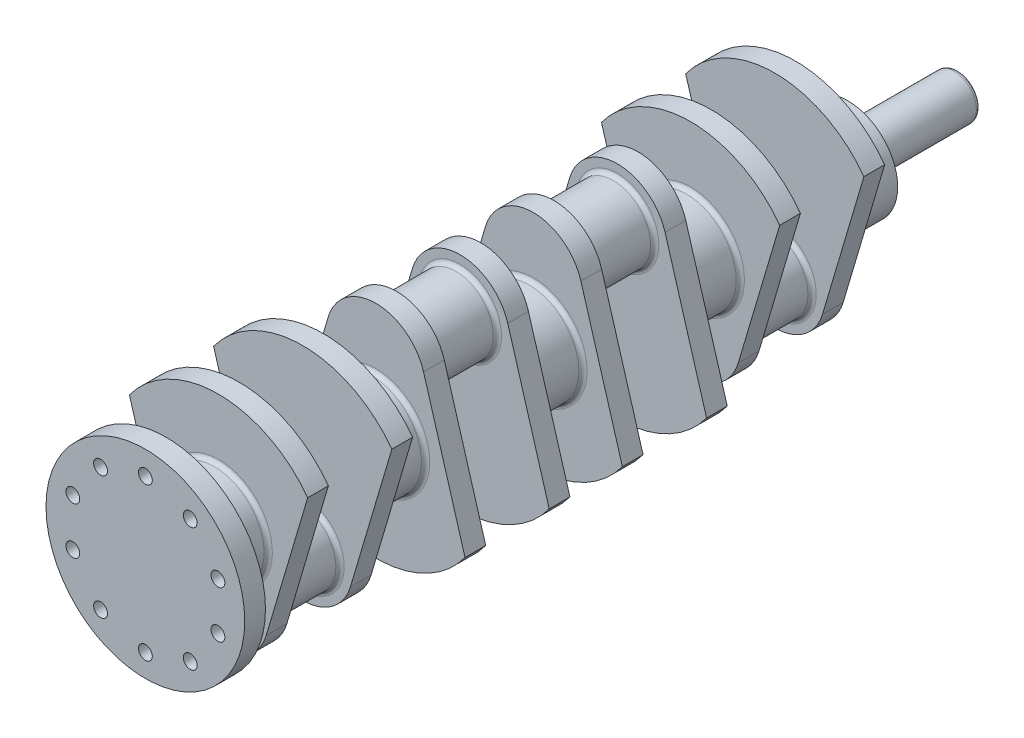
ISO-10303-21;
HEADER;
FILE_DESCRIPTION(('STEP AP214'),'2;1');
FILE_NAME('part.step','',(''),(''),'','','');
FILE_SCHEMA(('AUTOMOTIVE_DESIGN { 1 0 10303 214 1 1 1 1 }'));
ENDSEC;
DATA;
#1=APPLICATION_CONTEXT('core data for automotive mechanical design processes');
#2=APPLICATION_PROTOCOL_DEFINITION('international standard','automotive_design',2000,#1);
#3=PRODUCT_CONTEXT('',#1,'mechanical');
#4=PRODUCT('Part','Part','',(#3));
#5=PRODUCT_RELATED_PRODUCT_CATEGORY('part','',(#4));
#6=PRODUCT_DEFINITION_FORMATION('','',#4);
#7=PRODUCT_DEFINITION_CONTEXT('part definition',#1,'design');
#8=PRODUCT_DEFINITION('design','',#6,#7);
#9=PRODUCT_DEFINITION_SHAPE('','',#8);
#10=(LENGTH_UNIT() NAMED_UNIT(*) SI_UNIT(.MILLI.,.METRE.));
#11=(NAMED_UNIT(*) PLANE_ANGLE_UNIT() SI_UNIT($,.RADIAN.));
#12=(NAMED_UNIT(*) SI_UNIT($,.STERADIAN.) SOLID_ANGLE_UNIT());
#13=UNCERTAINTY_MEASURE_WITH_UNIT(LENGTH_MEASURE(1.E-05),#10,'distance_accuracy_value','');
#14=(GEOMETRIC_REPRESENTATION_CONTEXT(3) GLOBAL_UNCERTAINTY_ASSIGNED_CONTEXT((#13)) GLOBAL_UNIT_ASSIGNED_CONTEXT((#10,
#11,#12)) REPRESENTATION_CONTEXT('',''));
#15=CARTESIAN_POINT('',(0.,0.,0.));
#16=DIRECTION('',(0.,0.,1.));
#17=DIRECTION('',(1.,0.,0.));
#18=AXIS2_PLACEMENT_3D('',#15,#16,#17);
#19=CARTESIAN_POINT('',(0.,44.,114.));
#20=DIRECTION('',(0.,0.,-1.));
#21=DIRECTION('',(1.,0.,0.));
#22=AXIS2_PLACEMENT_3D('',#19,#20,#21);
#23=CYLINDRICAL_SURFACE('',#22,36.);
#24=CARTESIAN_POINT('',(0.,44.,79.));
#25=DIRECTION('',(0.,0.,1.));
#26=DIRECTION('',(1.,0.,0.));
#27=AXIS2_PLACEMENT_3D('',#24,#25,#26);
#28=CIRCLE('',#27,36.);
#29=CARTESIAN_POINT('',(36.,44.,79.));
#30=VERTEX_POINT('',#29);
#31=EDGE_CURVE('E555',#30,#30,#28,.F.);
#32=ORIENTED_EDGE('',*,*,#31,.F.);
#33=EDGE_LOOP('',(#32));
#34=FACE_BOUND('',#33,.T.);
#35=CARTESIAN_POINT('',(0.,44.0000000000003,111.));
#36=DIRECTION('',(0.,0.,-1.));
#37=DIRECTION('',(-1.,0.,0.));
#38=AXIS2_PLACEMENT_3D('',#35,#36,#37);
#39=CIRCLE('',#38,36.);
#40=CARTESIAN_POINT('',(-36.,44.0000000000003,111.));
#41=VERTEX_POINT('',#40);
#42=EDGE_CURVE('E611',#41,#41,#39,.F.);
#43=ORIENTED_EDGE('',*,*,#42,.F.);
#44=EDGE_LOOP('',(#43));
#45=FACE_BOUND('',#44,.T.);
#46=ADVANCED_FACE('F37',(#34,#45),#23,.T.);
#47=CARTESIAN_POINT('',(0.,44.,15.));
#48=DIRECTION('',(0.,0.,-1.));
#49=DIRECTION('',(-1.,0.,0.));
#50=AXIS2_PLACEMENT_3D('',#47,#48,#49);
#51=CYLINDRICAL_SURFACE('',#50,80.);
#52=CARTESIAN_POINT('',(0.,44.,0.));
#53=DIRECTION('',(0.,0.,1.));
#54=DIRECTION('',(1.,0.,0.));
#55=AXIS2_PLACEMENT_3D('',#52,#53,#54);
#56=CIRCLE('',#55,80.);
#57=CARTESIAN_POINT('',(-64.5698934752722,91.2305923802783,0.));
#58=VERTEX_POINT('',#57);
#59=CARTESIAN_POINT('',(64.5698934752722,91.2305923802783,0.));
#60=VERTEX_POINT('',#59);
#61=EDGE_CURVE('E570',#58,#60,#56,.F.);
#62=ORIENTED_EDGE('',*,*,#61,.F.);
#63=DIRECTION('',(0.,0.,-1.));
#64=VECTOR('',#63,1.);
#65=CARTESIAN_POINT('',(-64.5698934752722,91.2305923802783,15.));
#66=LINE('',#65,#64);
#67=CARTESIAN_POINT('',(-64.5698934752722,91.2305923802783,15.));
#68=VERTEX_POINT('',#67);
#69=EDGE_CURVE('E78',#68,#58,#66,.T.);
#70=ORIENTED_EDGE('',*,*,#69,.F.);
#71=CARTESIAN_POINT('',(0.,44.,15.));
#72=DIRECTION('',(0.,0.,1.));
#73=DIRECTION('',(1.,0.,0.));
#74=AXIS2_PLACEMENT_3D('',#71,#72,#73);
#75=CIRCLE('',#74,80.);
#76=CARTESIAN_POINT('',(64.5698934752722,91.2305923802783,15.));
#77=VERTEX_POINT('',#76);
#78=EDGE_CURVE('E571',#68,#77,#75,.F.);
#79=ORIENTED_EDGE('',*,*,#78,.T.);
#80=DIRECTION('',(0.,0.,-1.));
#81=VECTOR('',#80,1.);
#82=CARTESIAN_POINT('',(64.5698934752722,91.2305923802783,15.));
#83=LINE('',#82,#81);
#84=EDGE_CURVE('E54',#77,#60,#83,.T.);
#85=ORIENTED_EDGE('',*,*,#84,.T.);
#86=EDGE_LOOP('',(#62,#70,#79,#85));
#87=FACE_BOUND('',#86,.T.);
#88=ADVANCED_FACE('F634',(#87),#51,.T.);
#89=CARTESIAN_POINT('',(-34.517510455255,-10.2245524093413,15.));
#90=DIRECTION('',(0.958819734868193,0.284015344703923,0.));
#91=DIRECTION('',(-0.284015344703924,0.958819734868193,0.));
#92=AXIS2_PLACEMENT_3D('',#89,#90,#91);
#93=PLANE('',#92);
#94=DIRECTION('',(0.284015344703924,-0.958819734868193,0.));
#95=VECTOR('',#94,1.);
#96=CARTESIAN_POINT('',(-34.517510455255,-10.2245524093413,0.));
#97=LINE('',#96,#95);
#98=CARTESIAN_POINT('',(-34.5175104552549,-10.2245524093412,0.));
#99=VERTEX_POINT('',#98);
#100=EDGE_CURVE('E581',#58,#99,#97,.T.);
#101=ORIENTED_EDGE('',*,*,#100,.T.);
#102=DIRECTION('',(0.,0.,-1.));
#103=VECTOR('',#102,1.);
#104=CARTESIAN_POINT('',(-34.5175104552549,-10.2245524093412,15.));
#105=LINE('',#104,#103);
#106=CARTESIAN_POINT('',(-34.5175104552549,-10.2245524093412,15.));
#107=VERTEX_POINT('',#106);
#108=EDGE_CURVE('E589',#107,#99,#105,.T.);
#109=ORIENTED_EDGE('',*,*,#108,.F.);
#110=DIRECTION('',(0.284015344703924,-0.958819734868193,0.));
#111=VECTOR('',#110,1.);
#112=CARTESIAN_POINT('',(-34.517510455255,-10.2245524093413,15.));
#113=LINE('',#112,#111);
#114=EDGE_CURVE('E573',#68,#107,#113,.T.);
#115=ORIENTED_EDGE('',*,*,#114,.F.);
#116=ORIENTED_EDGE('',*,*,#69,.T.);
#117=EDGE_LOOP('',(#101,#109,#115,#116));
#118=FACE_BOUND('',#117,.T.);
#119=ADVANCED_FACE('F640',(#118),#93,.F.);
#120=CARTESIAN_POINT('',(0.,0.,15.));
#121=DIRECTION('',(0.,0.,-1.));
#122=DIRECTION('',(-1.,0.,0.));
#123=AXIS2_PLACEMENT_3D('',#120,#121,#122);
#124=CYLINDRICAL_SURFACE('',#123,36.);
#125=CARTESIAN_POINT('',(0.,0.,0.));
#126=DIRECTION('',(0.,0.,1.));
#127=DIRECTION('',(1.,0.,0.));
#128=AXIS2_PLACEMENT_3D('',#125,#126,#127);
#129=CIRCLE('',#128,36.);
#130=CARTESIAN_POINT('',(34.5175104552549,-10.2245524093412,0.));
#131=VERTEX_POINT('',#130);
#132=EDGE_CURVE('E583',#99,#131,#129,.T.);
#133=ORIENTED_EDGE('',*,*,#132,.T.);
#134=DIRECTION('',(0.,0.,-1.));
#135=VECTOR('',#134,1.);
#136=CARTESIAN_POINT('',(34.5175104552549,-10.2245524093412,15.));
#137=LINE('',#136,#135);
#138=CARTESIAN_POINT('',(34.5175104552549,-10.2245524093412,15.));
#139=VERTEX_POINT('',#138);
#140=EDGE_CURVE('E70',#139,#131,#137,.T.);
#141=ORIENTED_EDGE('',*,*,#140,.F.);
#142=CARTESIAN_POINT('',(0.,0.,15.));
#143=DIRECTION('',(0.,0.,1.));
#144=DIRECTION('',(1.,0.,0.));
#145=AXIS2_PLACEMENT_3D('',#142,#143,#144);
#146=CIRCLE('',#145,36.);
#147=EDGE_CURVE('E576',#107,#139,#146,.T.);
#148=ORIENTED_EDGE('',*,*,#147,.F.);
#149=ORIENTED_EDGE('',*,*,#108,.T.);
#150=EDGE_LOOP('',(#133,#141,#148,#149));
#151=FACE_BOUND('',#150,.T.);
#152=ADVANCED_FACE('F705',(#151),#124,.T.);
#153=CARTESIAN_POINT('',(34.517510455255,-10.2245524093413,15.));
#154=DIRECTION('',(0.958819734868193,-0.284015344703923,0.));
#155=DIRECTION('',(0.284015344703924,0.958819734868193,0.));
#156=AXIS2_PLACEMENT_3D('',#153,#154,#155);
#157=PLANE('',#156);
#158=DIRECTION('',(-0.284015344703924,-0.958819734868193,0.));
#159=VECTOR('',#158,1.);
#160=CARTESIAN_POINT('',(34.517510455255,-10.2245524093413,0.));
#161=LINE('',#160,#159);
#162=EDGE_CURVE('E574',#60,#131,#161,.T.);
#163=ORIENTED_EDGE('',*,*,#162,.F.);
#164=ORIENTED_EDGE('',*,*,#84,.F.);
#165=DIRECTION('',(-0.284015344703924,-0.958819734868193,0.));
#166=VECTOR('',#165,1.);
#167=CARTESIAN_POINT('',(34.517510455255,-10.2245524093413,15.));
#168=LINE('',#167,#166);
#169=EDGE_CURVE('E578',#77,#139,#168,.T.);
#170=ORIENTED_EDGE('',*,*,#169,.T.);
#171=ORIENTED_EDGE('',*,*,#140,.T.);
#172=EDGE_LOOP('',(#163,#164,#170,#171));
#173=FACE_BOUND('',#172,.T.);
#174=ADVANCED_FACE('F698',(#173),#157,.T.);
#175=CARTESIAN_POINT('',(0.,0.,15.));
#176=DIRECTION('',(0.,0.,1.));
#177=DIRECTION('',(1.,0.,0.));
#178=AXIS2_PLACEMENT_3D('',#175,#176,#177);
#179=PLANE('',#178);
#180=CARTESIAN_POINT('',(0.,0.,15.));
#181=DIRECTION('',(0.,0.,1.));
#182=DIRECTION('',(1.,0.,0.));
#183=AXIS2_PLACEMENT_3D('',#180,#181,#182);
#184=CIRCLE('',#183,30.);
#185=CARTESIAN_POINT('',(30.,0.,15.));
#186=VERTEX_POINT('',#185);
#187=EDGE_CURVE('E602',#186,#186,#184,.F.);
#188=ORIENTED_EDGE('',*,*,#187,.T.);
#189=EDGE_LOOP('',(#188));
#190=FACE_BOUND('',#189,.T.);
#191=ORIENTED_EDGE('',*,*,#78,.F.);
#192=ORIENTED_EDGE('',*,*,#114,.T.);
#193=ORIENTED_EDGE('',*,*,#147,.T.);
#194=ORIENTED_EDGE('',*,*,#169,.F.);
#195=EDGE_LOOP('',(#191,#192,#193,#194));
#196=FACE_BOUND('',#195,.T.);
#197=ADVANCED_FACE('F695',(#190,#196),#179,.T.);
#198=CARTESIAN_POINT('',(0.,0.,0.));
#199=DIRECTION('',(0.,0.,1.));
#200=DIRECTION('',(1.,0.,0.));
#201=AXIS2_PLACEMENT_3D('',#198,#199,#200);
#202=PLANE('',#201);
#203=CARTESIAN_POINT('',(0.,44.,0.));
#204=DIRECTION('',(0.,0.,1.));
#205=DIRECTION('',(1.,0.,0.));
#206=AXIS2_PLACEMENT_3D('',#203,#204,#205);
#207=CIRCLE('',#206,39.);
#208=CARTESIAN_POINT('',(39.,44.,0.));
#209=VERTEX_POINT('',#208);
#210=EDGE_CURVE('E596',#209,#209,#207,.T.);
#211=ORIENTED_EDGE('',*,*,#210,.T.);
#212=EDGE_LOOP('',(#211));
#213=FACE_BOUND('',#212,.T.);
#214=ORIENTED_EDGE('',*,*,#61,.T.);
#215=ORIENTED_EDGE('',*,*,#162,.T.);
#216=ORIENTED_EDGE('',*,*,#132,.F.);
#217=ORIENTED_EDGE('',*,*,#100,.F.);
#218=EDGE_LOOP('',(#214,#215,#216,#217));
#219=FACE_BOUND('',#218,.T.);
#220=ADVANCED_FACE('F693',(#213,#219),#202,.F.);
#221=CARTESIAN_POINT('',(0.,0.,38.));
#222=DIRECTION('',(0.,0.,-1.));
#223=DIRECTION('',(-1.,0.,0.));
#224=AXIS2_PLACEMENT_3D('',#221,#222,#223);
#225=CYLINDRICAL_SURFACE('',#224,27.);
#226=CARTESIAN_POINT('',(0.,0.,18.));
#227=DIRECTION('',(0.,0.,1.));
#228=DIRECTION('',(1.,0.,0.));
#229=AXIS2_PLACEMENT_3D('',#226,#227,#228);
#230=CIRCLE('',#229,27.);
#231=CARTESIAN_POINT('',(27.,0.,18.));
#232=VERTEX_POINT('',#231);
#233=EDGE_CURVE('E599',#232,#232,#230,.T.);
#234=ORIENTED_EDGE('',*,*,#233,.T.);
#235=EDGE_LOOP('',(#234));
#236=FACE_BOUND('',#235,.T.);
#237=CARTESIAN_POINT('',(0.,0.,58.));
#238=DIRECTION('',(0.,0.,1.));
#239=DIRECTION('',(1.,0.,0.));
#240=AXIS2_PLACEMENT_3D('',#237,#238,#239);
#241=CIRCLE('',#240,27.);
#242=CARTESIAN_POINT('',(27.,0.,58.));
#243=VERTEX_POINT('',#242);
#244=EDGE_CURVE('E561',#243,#243,#241,.T.);
#245=ORIENTED_EDGE('',*,*,#244,.F.);
#246=EDGE_LOOP('',(#245));
#247=FACE_BOUND('',#246,.T.);
#248=ADVANCED_FACE('F689',(#236,#247),#225,.T.);
#249=CARTESIAN_POINT('',(0.,44.,-38.));
#250=DIRECTION('',(0.,0.,1.));
#251=DIRECTION('',(1.,0.,0.));
#252=AXIS2_PLACEMENT_3D('',#249,#250,#251);
#253=CYLINDRICAL_SURFACE('',#252,36.);
#254=CARTESIAN_POINT('',(0.,44.,-3.));
#255=DIRECTION('',(0.,0.,1.));
#256=DIRECTION('',(1.,0.,0.));
#257=AXIS2_PLACEMENT_3D('',#254,#255,#256);
#258=CIRCLE('',#257,36.);
#259=CARTESIAN_POINT('',(36.,44.,-3.));
#260=VERTEX_POINT('',#259);
#261=EDGE_CURVE('E593',#260,#260,#258,.F.);
#262=ORIENTED_EDGE('',*,*,#261,.T.);
#263=EDGE_LOOP('',(#262));
#264=FACE_BOUND('',#263,.T.);
#265=CARTESIAN_POINT('',(0.,44.,-38.));
#266=DIRECTION('',(0.,0.,-1.));
#267=DIRECTION('',(-1.,0.,0.));
#268=AXIS2_PLACEMENT_3D('',#265,#266,#267);
#269=CIRCLE('',#268,36.);
#270=CARTESIAN_POINT('',(-36.,44.,-38.));
#271=VERTEX_POINT('',#270);
#272=EDGE_CURVE('E567',#271,#271,#269,.T.);
#273=ORIENTED_EDGE('',*,*,#272,.F.);
#274=EDGE_LOOP('',(#273));
#275=FACE_BOUND('',#274,.T.);
#276=ADVANCED_FACE('F685',(#264,#275),#253,.T.);
#277=CARTESIAN_POINT('',(0.,44.,-38.));
#278=DIRECTION('',(0.,0.,-1.));
#279=DIRECTION('',(-1.,0.,0.));
#280=AXIS2_PLACEMENT_3D('',#277,#278,#279);
#281=PLANE('',#280);
#282=CARTESIAN_POINT('',(0.,44.,-38.));
#283=DIRECTION('',(0.,0.,-1.));
#284=DIRECTION('',(-1.,0.,0.));
#285=AXIS2_PLACEMENT_3D('',#282,#283,#284);
#286=CIRCLE('',#285,19.);
#287=CARTESIAN_POINT('',(-19.,44.,-38.));
#288=VERTEX_POINT('',#287);
#289=EDGE_CURVE('E608',#288,#288,#286,.F.);
#290=ORIENTED_EDGE('',*,*,#289,.T.);
#291=EDGE_LOOP('',(#290));
#292=FACE_BOUND('',#291,.T.);
#293=ORIENTED_EDGE('',*,*,#272,.T.);
#294=EDGE_LOOP('',(#293));
#295=FACE_BOUND('',#294,.T.);
#296=ADVANCED_FACE('F681',(#292,#295),#281,.T.);
#297=CARTESIAN_POINT('',(0.,44.,-3.));
#298=DIRECTION('',(0.,0.,1.));
#299=DIRECTION('',(1.,0.,0.));
#300=AXIS2_PLACEMENT_3D('',#297,#298,#299);
#301=TOROIDAL_SURFACE('',#300,39.,3.);
#302=ORIENTED_EDGE('',*,*,#210,.F.);
#303=EDGE_LOOP('',(#302));
#304=FACE_BOUND('',#303,.T.);
#305=ORIENTED_EDGE('',*,*,#261,.F.);
#306=EDGE_LOOP('',(#305));
#307=FACE_BOUND('',#306,.T.);
#308=ADVANCED_FACE('F684',(#304,#307),#301,.F.);
#309=CARTESIAN_POINT('',(0.,0.,18.));
#310=DIRECTION('',(0.,0.,1.));
#311=DIRECTION('',(1.,0.,0.));
#312=AXIS2_PLACEMENT_3D('',#309,#310,#311);
#313=TOROIDAL_SURFACE('',#312,30.,3.);
#314=ORIENTED_EDGE('',*,*,#187,.F.);
#315=EDGE_LOOP('',(#314));
#316=FACE_BOUND('',#315,.T.);
#317=ORIENTED_EDGE('',*,*,#233,.F.);
#318=EDGE_LOOP('',(#317));
#319=FACE_BOUND('',#318,.T.);
#320=ADVANCED_FACE('F672',(#316,#319),#313,.F.);
#321=CARTESIAN_POINT('',(0.,44.,61.));
#322=DIRECTION('',(0.,0.,1.));
#323=DIRECTION('',(-1.,0.,0.));
#324=AXIS2_PLACEMENT_3D('',#321,#322,#323);
#325=CYLINDRICAL_SURFACE('',#324,80.);
#326=CARTESIAN_POINT('',(0.,44.,76.));
#327=DIRECTION('',(0.,0.,1.));
#328=DIRECTION('',(1.,0.,0.));
#329=AXIS2_PLACEMENT_3D('',#326,#327,#328);
#330=CIRCLE('',#329,80.);
#331=CARTESIAN_POINT('',(-64.5698934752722,91.2305923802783,76.));
#332=VERTEX_POINT('',#331);
#333=CARTESIAN_POINT('',(64.5698934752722,91.2305923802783,76.));
#334=VERTEX_POINT('',#333);
#335=EDGE_CURVE('E521',#332,#334,#330,.F.);
#336=ORIENTED_EDGE('',*,*,#335,.T.);
#337=DIRECTION('',(0.,0.,1.));
#338=VECTOR('',#337,1.);
#339=CARTESIAN_POINT('',(64.5698934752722,91.2305923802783,61.));
#340=LINE('',#339,#338);
#341=CARTESIAN_POINT('',(64.5698934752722,91.2305923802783,61.));
#342=VERTEX_POINT('',#341);
#343=EDGE_CURVE('E534',#342,#334,#340,.T.);
#344=ORIENTED_EDGE('',*,*,#343,.F.);
#345=CARTESIAN_POINT('',(0.,44.,61.));
#346=DIRECTION('',(0.,0.,1.));
#347=DIRECTION('',(1.,0.,0.));
#348=AXIS2_PLACEMENT_3D('',#345,#346,#347);
#349=CIRCLE('',#348,80.);
#350=CARTESIAN_POINT('',(-64.5698934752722,91.2305923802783,61.));
#351=VERTEX_POINT('',#350);
#352=EDGE_CURVE('E522',#351,#342,#349,.F.);
#353=ORIENTED_EDGE('',*,*,#352,.F.);
#354=DIRECTION('',(0.,0.,1.));
#355=VECTOR('',#354,1.);
#356=CARTESIAN_POINT('',(-64.5698934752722,91.2305923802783,61.));
#357=LINE('',#356,#355);
#358=EDGE_CURVE('E552',#351,#332,#357,.T.);
#359=ORIENTED_EDGE('',*,*,#358,.T.);
#360=EDGE_LOOP('',(#336,#344,#353,#359));
#361=FACE_BOUND('',#360,.T.);
#362=ADVANCED_FACE('F668',(#361),#325,.T.);
#363=CARTESIAN_POINT('',(-34.517510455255,-10.2245524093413,61.));
#364=DIRECTION('',(0.958819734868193,0.284015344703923,0.));
#365=DIRECTION('',(-0.284015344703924,0.958819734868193,0.));
#366=AXIS2_PLACEMENT_3D('',#363,#364,#365);
#367=PLANE('',#366);
#368=DIRECTION('',(0.284015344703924,-0.958819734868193,0.));
#369=VECTOR('',#368,1.);
#370=CARTESIAN_POINT('',(-34.517510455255,-10.2245524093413,76.));
#371=LINE('',#370,#369);
#372=CARTESIAN_POINT('',(-34.5175104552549,-10.2245524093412,76.));
#373=VERTEX_POINT('',#372);
#374=EDGE_CURVE('E537',#332,#373,#371,.T.);
#375=ORIENTED_EDGE('',*,*,#374,.F.);
#376=ORIENTED_EDGE('',*,*,#358,.F.);
#377=DIRECTION('',(0.284015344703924,-0.958819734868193,0.));
#378=VECTOR('',#377,1.);
#379=CARTESIAN_POINT('',(-34.517510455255,-10.2245524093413,61.));
#380=LINE('',#379,#378);
#381=CARTESIAN_POINT('',(-34.5175104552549,-10.2245524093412,61.));
#382=VERTEX_POINT('',#381);
#383=EDGE_CURVE('E525',#351,#382,#380,.T.);
#384=ORIENTED_EDGE('',*,*,#383,.T.);
#385=DIRECTION('',(0.,0.,1.));
#386=VECTOR('',#385,1.);
#387=CARTESIAN_POINT('',(-34.5175104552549,-10.2245524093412,61.));
#388=LINE('',#387,#386);
#389=EDGE_CURVE('E549',#382,#373,#388,.T.);
#390=ORIENTED_EDGE('',*,*,#389,.T.);
#391=EDGE_LOOP('',(#375,#376,#384,#390));
#392=FACE_BOUND('',#391,.T.);
#393=ADVANCED_FACE('F664',(#392),#367,.F.);
#394=CARTESIAN_POINT('',(0.,0.,61.));
#395=DIRECTION('',(0.,0.,1.));
#396=DIRECTION('',(-1.,0.,0.));
#397=AXIS2_PLACEMENT_3D('',#394,#395,#396);
#398=CYLINDRICAL_SURFACE('',#397,36.);
#399=CARTESIAN_POINT('',(0.,0.,76.));
#400=DIRECTION('',(0.,0.,1.));
#401=DIRECTION('',(1.,0.,0.));
#402=AXIS2_PLACEMENT_3D('',#399,#400,#401);
#403=CIRCLE('',#402,36.);
#404=CARTESIAN_POINT('',(34.5175104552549,-10.2245524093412,76.));
#405=VERTEX_POINT('',#404);
#406=EDGE_CURVE('E540',#373,#405,#403,.T.);
#407=ORIENTED_EDGE('',*,*,#406,.F.);
#408=ORIENTED_EDGE('',*,*,#389,.F.);
#409=CARTESIAN_POINT('',(0.,0.,61.));
#410=DIRECTION('',(0.,0.,1.));
#411=DIRECTION('',(1.,0.,0.));
#412=AXIS2_PLACEMENT_3D('',#409,#410,#411);
#413=CIRCLE('',#412,36.);
#414=CARTESIAN_POINT('',(34.5175104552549,-10.2245524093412,61.));
#415=VERTEX_POINT('',#414);
#416=EDGE_CURVE('E529',#382,#415,#413,.T.);
#417=ORIENTED_EDGE('',*,*,#416,.T.);
#418=DIRECTION('',(0.,0.,1.));
#419=VECTOR('',#418,1.);
#420=CARTESIAN_POINT('',(34.5175104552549,-10.2245524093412,61.));
#421=LINE('',#420,#419);
#422=EDGE_CURVE('E546',#415,#405,#421,.T.);
#423=ORIENTED_EDGE('',*,*,#422,.T.);
#424=EDGE_LOOP('',(#407,#408,#417,#423));
#425=FACE_BOUND('',#424,.T.);
#426=ADVANCED_FACE('F660',(#425),#398,.T.);
#427=CARTESIAN_POINT('',(34.517510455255,-10.2245524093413,61.));
#428=DIRECTION('',(0.958819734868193,-0.284015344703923,0.));
#429=DIRECTION('',(0.284015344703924,0.958819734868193,0.));
#430=AXIS2_PLACEMENT_3D('',#427,#428,#429);
#431=PLANE('',#430);
#432=DIRECTION('',(-0.284015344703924,-0.958819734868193,0.));
#433=VECTOR('',#432,1.);
#434=CARTESIAN_POINT('',(34.517510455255,-10.2245524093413,76.));
#435=LINE('',#434,#433);
#436=EDGE_CURVE('E526',#334,#405,#435,.T.);
#437=ORIENTED_EDGE('',*,*,#436,.T.);
#438=ORIENTED_EDGE('',*,*,#422,.F.);
#439=DIRECTION('',(-0.284015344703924,-0.958819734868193,0.));
#440=VECTOR('',#439,1.);
#441=CARTESIAN_POINT('',(34.517510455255,-10.2245524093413,61.));
#442=LINE('',#441,#440);
#443=EDGE_CURVE('E532',#342,#415,#442,.T.);
#444=ORIENTED_EDGE('',*,*,#443,.F.);
#445=ORIENTED_EDGE('',*,*,#343,.T.);
#446=EDGE_LOOP('',(#437,#438,#444,#445));
#447=FACE_BOUND('',#446,.T.);
#448=ADVANCED_FACE('F652',(#447),#431,.T.);
#449=CARTESIAN_POINT('',(0.,0.,61.));
#450=DIRECTION('',(0.,0.,-1.));
#451=DIRECTION('',(1.,0.,0.));
#452=AXIS2_PLACEMENT_3D('',#449,#450,#451);
#453=PLANE('',#452);
#454=CARTESIAN_POINT('',(0.,0.,61.));
#455=DIRECTION('',(0.,0.,1.));
#456=DIRECTION('',(1.,0.,0.));
#457=AXIS2_PLACEMENT_3D('',#454,#455,#456);
#458=CIRCLE('',#457,30.);
#459=CARTESIAN_POINT('',(30.,0.,61.));
#460=VERTEX_POINT('',#459);
#461=EDGE_CURVE('E564',#460,#460,#458,.F.);
#462=ORIENTED_EDGE('',*,*,#461,.F.);
#463=EDGE_LOOP('',(#462));
#464=FACE_BOUND('',#463,.T.);
#465=ORIENTED_EDGE('',*,*,#352,.T.);
#466=ORIENTED_EDGE('',*,*,#443,.T.);
#467=ORIENTED_EDGE('',*,*,#416,.F.);
#468=ORIENTED_EDGE('',*,*,#383,.F.);
#469=EDGE_LOOP('',(#465,#466,#467,#468));
#470=FACE_BOUND('',#469,.T.);
#471=ADVANCED_FACE('F648',(#464,#470),#453,.T.);
#472=CARTESIAN_POINT('',(0.,0.,76.));
#473=DIRECTION('',(0.,0.,-1.));
#474=DIRECTION('',(1.,0.,0.));
#475=AXIS2_PLACEMENT_3D('',#472,#473,#474);
#476=PLANE('',#475);
#477=CARTESIAN_POINT('',(0.,44.,76.));
#478=DIRECTION('',(0.,0.,1.));
#479=DIRECTION('',(1.,0.,0.));
#480=AXIS2_PLACEMENT_3D('',#477,#478,#479);
#481=CIRCLE('',#480,39.);
#482=CARTESIAN_POINT('',(39.,44.,76.));
#483=VERTEX_POINT('',#482);
#484=EDGE_CURVE('E558',#483,#483,#481,.T.);
#485=ORIENTED_EDGE('',*,*,#484,.F.);
#486=EDGE_LOOP('',(#485));
#487=FACE_BOUND('',#486,.T.);
#488=ORIENTED_EDGE('',*,*,#335,.F.);
#489=ORIENTED_EDGE('',*,*,#374,.T.);
#490=ORIENTED_EDGE('',*,*,#406,.T.);
#491=ORIENTED_EDGE('',*,*,#436,.F.);
#492=EDGE_LOOP('',(#488,#489,#490,#491));
#493=FACE_BOUND('',#492,.T.);
#494=ADVANCED_FACE('F651',(#487,#493),#476,.F.);
#495=CARTESIAN_POINT('',(0.,44.,79.));
#496=DIRECTION('',(0.,0.,-1.));
#497=DIRECTION('',(1.,0.,0.));
#498=AXIS2_PLACEMENT_3D('',#495,#496,#497);
#499=TOROIDAL_SURFACE('',#498,39.,3.);
#500=ORIENTED_EDGE('',*,*,#484,.T.);
#501=EDGE_LOOP('',(#500));
#502=FACE_BOUND('',#501,.T.);
#503=ORIENTED_EDGE('',*,*,#31,.T.);
#504=EDGE_LOOP('',(#503));
#505=FACE_BOUND('',#504,.T.);
#506=ADVANCED_FACE('F656',(#502,#505),#499,.F.);
#507=CARTESIAN_POINT('',(0.,0.,58.));
#508=DIRECTION('',(0.,0.,-1.));
#509=DIRECTION('',(1.,0.,0.));
#510=AXIS2_PLACEMENT_3D('',#507,#508,#509);
#511=TOROIDAL_SURFACE('',#510,30.,3.);
#512=ORIENTED_EDGE('',*,*,#461,.T.);
#513=EDGE_LOOP('',(#512));
#514=FACE_BOUND('',#513,.T.);
#515=ORIENTED_EDGE('',*,*,#244,.T.);
#516=EDGE_LOOP('',(#515));
#517=FACE_BOUND('',#516,.T.);
#518=ADVANCED_FACE('F676',(#514,#517),#511,.F.);
#519=CARTESIAN_POINT('',(0.,44.,-118.));
#520=DIRECTION('',(0.,0.,1.));
#521=DIRECTION('',(1.,0.,0.));
#522=AXIS2_PLACEMENT_3D('',#519,#520,#521);
#523=CYLINDRICAL_SURFACE('',#522,16.);
#524=CARTESIAN_POINT('',(0.,44.,-115.));
#525=DIRECTION('',(0.,0.,-1.));
#526=DIRECTION('',(-1.,0.,0.));
#527=AXIS2_PLACEMENT_3D('',#524,#525,#526);
#528=CIRCLE('',#527,16.);
#529=CARTESIAN_POINT('',(-16.,44.,-115.));
#530=VERTEX_POINT('',#529);
#531=EDGE_CURVE('E11',#530,#530,#528,.F.);
#532=ORIENTED_EDGE('',*,*,#531,.T.);
#533=EDGE_LOOP('',(#532));
#534=FACE_BOUND('',#533,.T.);
#535=CARTESIAN_POINT('',(0.,44.,-41.));
#536=DIRECTION('',(0.,0.,-1.));
#537=DIRECTION('',(-1.,0.,0.));
#538=AXIS2_PLACEMENT_3D('',#535,#536,#537);
#539=CIRCLE('',#538,16.);
#540=CARTESIAN_POINT('',(-16.,44.,-41.));
#541=VERTEX_POINT('',#540);
#542=EDGE_CURVE('E605',#541,#541,#539,.T.);
#543=ORIENTED_EDGE('',*,*,#542,.T.);
#544=EDGE_LOOP('',(#543));
#545=FACE_BOUND('',#544,.T.);
#546=ADVANCED_FACE('F646',(#534,#545),#523,.T.);
#547=CARTESIAN_POINT('',(0.,44.,-118.));
#548=DIRECTION('',(0.,0.,-1.));
#549=DIRECTION('',(-1.,0.,0.));
#550=AXIS2_PLACEMENT_3D('',#547,#548,#549);
#551=PLANE('',#550);
#552=CARTESIAN_POINT('',(0.,44.,-118.));
#553=DIRECTION('',(0.,0.,-1.));
#554=DIRECTION('',(-1.,0.,0.));
#555=AXIS2_PLACEMENT_3D('',#552,#553,#554);
#556=CIRCLE('',#555,13.);
#557=CARTESIAN_POINT('',(-13.,44.,-118.));
#558=VERTEX_POINT('',#557);
#559=EDGE_CURVE('E46',#558,#558,#556,.T.);
#560=ORIENTED_EDGE('',*,*,#559,.T.);
#561=EDGE_LOOP('',(#560));
#562=FACE_BOUND('',#561,.T.);
#563=ADVANCED_FACE('F622',(#562),#551,.T.);
#564=CARTESIAN_POINT('',(0.,44.,-41.));
#565=DIRECTION('',(0.,0.,-1.));
#566=DIRECTION('',(-1.,0.,0.));
#567=AXIS2_PLACEMENT_3D('',#564,#565,#566);
#568=TOROIDAL_SURFACE('',#567,19.,3.);
#569=ORIENTED_EDGE('',*,*,#289,.F.);
#570=EDGE_LOOP('',(#569));
#571=FACE_BOUND('',#570,.T.);
#572=ORIENTED_EDGE('',*,*,#542,.F.);
#573=EDGE_LOOP('',(#572));
#574=FACE_BOUND('',#573,.T.);
#575=ADVANCED_FACE('F718',(#571,#574),#568,.F.);
#576=CARTESIAN_POINT('',(0.,43.9999999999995,228.));
#577=DIRECTION('',(0.,0.,-1.));
#578=DIRECTION('',(1.,0.,0.));
#579=AXIS2_PLACEMENT_3D('',#576,#577,#578);
#580=CYLINDRICAL_SURFACE('',#579,36.);
#581=CARTESIAN_POINT('',(0.,43.9999999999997,193.));
#582=DIRECTION('',(0.,0.,-1.));
#583=DIRECTION('',(1.,0.,0.));
#584=AXIS2_PLACEMENT_3D('',#581,#582,#583);
#585=CIRCLE('',#584,36.);
#586=CARTESIAN_POINT('',(36.,43.9999999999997,193.));
#587=VERTEX_POINT('',#586);
#588=EDGE_CURVE('E463',#587,#587,#585,.F.);
#589=ORIENTED_EDGE('',*,*,#588,.T.);
#590=EDGE_LOOP('',(#589));
#591=FACE_BOUND('',#590,.T.);
#592=CARTESIAN_POINT('',(0.,43.9999999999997,224.999999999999));
#593=DIRECTION('',(0.,0.,-1.));
#594=DIRECTION('',(0.,1.,0.));
#595=AXIS2_PLACEMENT_3D('',#592,#593,#594);
#596=CIRCLE('',#595,36.);
#597=CARTESIAN_POINT('',(0.,79.9999999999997,225.));
#598=VERTEX_POINT('',#597);
#599=EDGE_CURVE('E518',#598,#598,#596,.F.);
#600=ORIENTED_EDGE('',*,*,#599,.F.);
#601=EDGE_LOOP('',(#600));
#602=FACE_BOUND('',#601,.T.);
#603=ADVANCED_FACE('F720',(#591,#602),#580,.T.);
#604=CARTESIAN_POINT('',(0.,44.0000000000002,129.));
#605=DIRECTION('',(0.,0.,-1.));
#606=DIRECTION('',(-1.,0.,0.));
#607=AXIS2_PLACEMENT_3D('',#604,#605,#606);
#608=CYLINDRICAL_SURFACE('',#607,80.);
#609=CARTESIAN_POINT('',(0.,44.0000000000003,114.));
#610=DIRECTION('',(0.,0.,-1.));
#611=DIRECTION('',(1.,0.,0.));
#612=AXIS2_PLACEMENT_3D('',#609,#610,#611);
#613=CIRCLE('',#612,80.);
#614=CARTESIAN_POINT('',(-64.5698934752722,-3.23059238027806,114.));
#615=VERTEX_POINT('',#614);
#616=CARTESIAN_POINT('',(64.5698934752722,-3.23059238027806,114.));
#617=VERTEX_POINT('',#616);
#618=EDGE_CURVE('E475',#615,#617,#613,.F.);
#619=ORIENTED_EDGE('',*,*,#618,.T.);
#620=DIRECTION('',(0.,0.,-1.));
#621=VECTOR('',#620,1.);
#622=CARTESIAN_POINT('',(64.5698934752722,-3.23059238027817,129.));
#623=LINE('',#622,#621);
#624=CARTESIAN_POINT('',(64.5698934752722,-3.23059238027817,129.));
#625=VERTEX_POINT('',#624);
#626=EDGE_CURVE('E488',#625,#617,#623,.T.);
#627=ORIENTED_EDGE('',*,*,#626,.F.);
#628=CARTESIAN_POINT('',(0.,44.0000000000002,129.));
#629=DIRECTION('',(0.,0.,-1.));
#630=DIRECTION('',(1.,0.,0.));
#631=AXIS2_PLACEMENT_3D('',#628,#629,#630);
#632=CIRCLE('',#631,80.);
#633=CARTESIAN_POINT('',(-64.5698934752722,-3.23059238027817,129.));
#634=VERTEX_POINT('',#633);
#635=EDGE_CURVE('E476',#634,#625,#632,.F.);
#636=ORIENTED_EDGE('',*,*,#635,.F.);
#637=DIRECTION('',(0.,0.,-1.));
#638=VECTOR('',#637,1.);
#639=CARTESIAN_POINT('',(-64.5698934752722,-3.23059238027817,129.));
#640=LINE('',#639,#638);
#641=EDGE_CURVE('E506',#634,#615,#640,.T.);
#642=ORIENTED_EDGE('',*,*,#641,.T.);
#643=EDGE_LOOP('',(#619,#627,#636,#642));
#644=FACE_BOUND('',#643,.T.);
#645=ADVANCED_FACE('F726',(#644),#608,.T.);
#646=CARTESIAN_POINT('',(-34.517510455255,98.2245524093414,129.));
#647=DIRECTION('',(0.958819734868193,-0.284015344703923,0.));
#648=DIRECTION('',(-0.284015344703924,-0.958819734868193,0.));
#649=AXIS2_PLACEMENT_3D('',#646,#647,#648);
#650=PLANE('',#649);
#651=DIRECTION('',(0.284015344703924,0.958819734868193,0.));
#652=VECTOR('',#651,1.);
#653=CARTESIAN_POINT('',(-34.517510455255,98.2245524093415,114.));
#654=LINE('',#653,#652);
#655=CARTESIAN_POINT('',(-34.5175104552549,98.2245524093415,114.));
#656=VERTEX_POINT('',#655);
#657=EDGE_CURVE('E491',#615,#656,#654,.T.);
#658=ORIENTED_EDGE('',*,*,#657,.F.);
#659=ORIENTED_EDGE('',*,*,#641,.F.);
#660=DIRECTION('',(0.284015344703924,0.958819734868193,0.));
#661=VECTOR('',#660,1.);
#662=CARTESIAN_POINT('',(-34.517510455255,98.2245524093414,129.));
#663=LINE('',#662,#661);
#664=CARTESIAN_POINT('',(-34.5175104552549,98.2245524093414,129.));
#665=VERTEX_POINT('',#664);
#666=EDGE_CURVE('E479',#634,#665,#663,.T.);
#667=ORIENTED_EDGE('',*,*,#666,.T.);
#668=DIRECTION('',(0.,0.,-1.));
#669=VECTOR('',#668,1.);
#670=CARTESIAN_POINT('',(-34.5175104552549,98.2245524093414,129.));
#671=LINE('',#670,#669);
#672=EDGE_CURVE('E503',#665,#656,#671,.T.);
#673=ORIENTED_EDGE('',*,*,#672,.T.);
#674=EDGE_LOOP('',(#658,#659,#667,#673));
#675=FACE_BOUND('',#674,.T.);
#676=ADVANCED_FACE('F1412',(#675),#650,.F.);
#677=CARTESIAN_POINT('',(0.,88.0000000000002,129.));
#678=DIRECTION('',(0.,0.,-1.));
#679=DIRECTION('',(-1.,0.,0.));
#680=AXIS2_PLACEMENT_3D('',#677,#678,#679);
#681=CYLINDRICAL_SURFACE('',#680,36.);
#682=CARTESIAN_POINT('',(0.,88.0000000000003,114.));
#683=DIRECTION('',(0.,0.,-1.));
#684=DIRECTION('',(1.,0.,0.));
#685=AXIS2_PLACEMENT_3D('',#682,#683,#684);
#686=CIRCLE('',#685,36.);
#687=CARTESIAN_POINT('',(34.5175104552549,98.2245524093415,114.));
#688=VERTEX_POINT('',#687);
#689=EDGE_CURVE('E494',#656,#688,#686,.T.);
#690=ORIENTED_EDGE('',*,*,#689,.F.);
#691=ORIENTED_EDGE('',*,*,#672,.F.);
#692=CARTESIAN_POINT('',(0.,88.0000000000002,129.));
#693=DIRECTION('',(0.,0.,-1.));
#694=DIRECTION('',(1.,0.,0.));
#695=AXIS2_PLACEMENT_3D('',#692,#693,#694);
#696=CIRCLE('',#695,36.);
#697=CARTESIAN_POINT('',(34.5175104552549,98.2245524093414,129.));
#698=VERTEX_POINT('',#697);
#699=EDGE_CURVE('E483',#665,#698,#696,.T.);
#700=ORIENTED_EDGE('',*,*,#699,.T.);
#701=DIRECTION('',(0.,0.,-1.));
#702=VECTOR('',#701,1.);
#703=CARTESIAN_POINT('',(34.5175104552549,98.2245524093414,129.));
#704=LINE('',#703,#702);
#705=EDGE_CURVE('E500',#698,#688,#704,.T.);
#706=ORIENTED_EDGE('',*,*,#705,.T.);
#707=EDGE_LOOP('',(#690,#691,#700,#706));
#708=FACE_BOUND('',#707,.T.);
#709=ADVANCED_FACE('F1402',(#708),#681,.T.);
#710=CARTESIAN_POINT('',(34.517510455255,98.2245524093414,129.));
#711=DIRECTION('',(0.958819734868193,0.284015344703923,0.));
#712=DIRECTION('',(0.284015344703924,-0.958819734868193,0.));
#713=AXIS2_PLACEMENT_3D('',#710,#711,#712);
#714=PLANE('',#713);
#715=DIRECTION('',(-0.284015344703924,0.958819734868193,0.));
#716=VECTOR('',#715,1.);
#717=CARTESIAN_POINT('',(34.517510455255,98.2245524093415,114.));
#718=LINE('',#717,#716);
#719=EDGE_CURVE('E480',#617,#688,#718,.T.);
#720=ORIENTED_EDGE('',*,*,#719,.T.);
#721=ORIENTED_EDGE('',*,*,#705,.F.);
#722=DIRECTION('',(-0.284015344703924,0.958819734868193,0.));
#723=VECTOR('',#722,1.);
#724=CARTESIAN_POINT('',(34.517510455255,98.2245524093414,129.));
#725=LINE('',#724,#723);
#726=EDGE_CURVE('E486',#625,#698,#725,.T.);
#727=ORIENTED_EDGE('',*,*,#726,.F.);
#728=ORIENTED_EDGE('',*,*,#626,.T.);
#729=EDGE_LOOP('',(#720,#721,#727,#728));
#730=FACE_BOUND('',#729,.T.);
#731=ADVANCED_FACE('F1392',(#730),#714,.T.);
#732=CARTESIAN_POINT('',(0.,88.0000000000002,129.));
#733=DIRECTION('',(0.,0.,1.));
#734=DIRECTION('',(1.,0.,0.));
#735=AXIS2_PLACEMENT_3D('',#732,#733,#734);
#736=PLANE('',#735);
#737=CARTESIAN_POINT('',(0.,88.0000000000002,129.));
#738=DIRECTION('',(0.,0.,-1.));
#739=DIRECTION('',(1.,0.,0.));
#740=AXIS2_PLACEMENT_3D('',#737,#738,#739);
#741=CIRCLE('',#740,30.);
#742=CARTESIAN_POINT('',(30.,88.0000000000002,129.));
#743=VERTEX_POINT('',#742);
#744=EDGE_CURVE('E515',#743,#743,#741,.F.);
#745=ORIENTED_EDGE('',*,*,#744,.F.);
#746=EDGE_LOOP('',(#745));
#747=FACE_BOUND('',#746,.T.);
#748=ORIENTED_EDGE('',*,*,#635,.T.);
#749=ORIENTED_EDGE('',*,*,#726,.T.);
#750=ORIENTED_EDGE('',*,*,#699,.F.);
#751=ORIENTED_EDGE('',*,*,#666,.F.);
#752=EDGE_LOOP('',(#748,#749,#750,#751));
#753=FACE_BOUND('',#752,.T.);
#754=ADVANCED_FACE('F1381',(#747,#753),#736,.T.);
#755=CARTESIAN_POINT('',(0.,88.0000000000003,114.));
#756=DIRECTION('',(0.,0.,1.));
#757=DIRECTION('',(1.,0.,0.));
#758=AXIS2_PLACEMENT_3D('',#755,#756,#757);
#759=PLANE('',#758);
#760=CARTESIAN_POINT('',(0.,44.0000000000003,114.));
#761=DIRECTION('',(0.,0.,-1.));
#762=DIRECTION('',(1.,0.,0.));
#763=AXIS2_PLACEMENT_3D('',#760,#761,#762);
#764=CIRCLE('',#763,39.);
#765=CARTESIAN_POINT('',(39.,44.0000000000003,114.));
#766=VERTEX_POINT('',#765);
#767=EDGE_CURVE('E509',#766,#766,#764,.T.);
#768=ORIENTED_EDGE('',*,*,#767,.F.);
#769=EDGE_LOOP('',(#768));
#770=FACE_BOUND('',#769,.T.);
#771=ORIENTED_EDGE('',*,*,#618,.F.);
#772=ORIENTED_EDGE('',*,*,#657,.T.);
#773=ORIENTED_EDGE('',*,*,#689,.T.);
#774=ORIENTED_EDGE('',*,*,#719,.F.);
#775=EDGE_LOOP('',(#771,#772,#773,#774));
#776=FACE_BOUND('',#775,.T.);
#777=ADVANCED_FACE('F1370',(#770,#776),#759,.F.);
#778=CARTESIAN_POINT('',(0.,88.,152.));
#779=DIRECTION('',(0.,0.,-1.));
#780=DIRECTION('',(-1.,0.,0.));
#781=AXIS2_PLACEMENT_3D('',#778,#779,#780);
#782=CYLINDRICAL_SURFACE('',#781,27.);
#783=CARTESIAN_POINT('',(0.,88.0000000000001,132.));
#784=DIRECTION('',(0.,0.,-1.));
#785=DIRECTION('',(1.,0.,0.));
#786=AXIS2_PLACEMENT_3D('',#783,#784,#785);
#787=CIRCLE('',#786,27.);
#788=CARTESIAN_POINT('',(27.,88.0000000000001,132.));
#789=VERTEX_POINT('',#788);
#790=EDGE_CURVE('E512',#789,#789,#787,.T.);
#791=ORIENTED_EDGE('',*,*,#790,.F.);
#792=EDGE_LOOP('',(#791));
#793=FACE_BOUND('',#792,.T.);
#794=CARTESIAN_POINT('',(0.,87.9999999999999,172.));
#795=DIRECTION('',(0.,0.,-1.));
#796=DIRECTION('',(1.,0.,0.));
#797=AXIS2_PLACEMENT_3D('',#794,#795,#796);
#798=CIRCLE('',#797,27.);
#799=CARTESIAN_POINT('',(27.,87.9999999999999,172.));
#800=VERTEX_POINT('',#799);
#801=EDGE_CURVE('E469',#800,#800,#798,.T.);
#802=ORIENTED_EDGE('',*,*,#801,.T.);
#803=EDGE_LOOP('',(#802));
#804=FACE_BOUND('',#803,.T.);
#805=ADVANCED_FACE('F1359',(#793,#804),#782,.T.);
#806=CARTESIAN_POINT('',(0.,44.0000000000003,111.));
#807=DIRECTION('',(0.,0.,1.));
#808=DIRECTION('',(1.,0.,0.));
#809=AXIS2_PLACEMENT_3D('',#806,#807,#808);
#810=TOROIDAL_SURFACE('',#809,39.,3.);
#811=ORIENTED_EDGE('',*,*,#767,.T.);
#812=EDGE_LOOP('',(#811));
#813=FACE_BOUND('',#812,.T.);
#814=ORIENTED_EDGE('',*,*,#42,.T.);
#815=EDGE_LOOP('',(#814));
#816=FACE_BOUND('',#815,.T.);
#817=ADVANCED_FACE('F1349',(#813,#816),#810,.F.);
#818=CARTESIAN_POINT('',(0.,88.0000000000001,132.));
#819=DIRECTION('',(0.,0.,1.));
#820=DIRECTION('',(1.,0.,0.));
#821=AXIS2_PLACEMENT_3D('',#818,#819,#820);
#822=TOROIDAL_SURFACE('',#821,30.,3.);
#823=ORIENTED_EDGE('',*,*,#744,.T.);
#824=EDGE_LOOP('',(#823));
#825=FACE_BOUND('',#824,.T.);
#826=ORIENTED_EDGE('',*,*,#790,.T.);
#827=EDGE_LOOP('',(#826));
#828=FACE_BOUND('',#827,.T.);
#829=ADVANCED_FACE('F1339',(#825,#828),#822,.F.);
#830=CARTESIAN_POINT('',(0.,43.9999999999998,175.));
#831=DIRECTION('',(0.,0.,1.));
#832=DIRECTION('',(-1.,0.,0.));
#833=AXIS2_PLACEMENT_3D('',#830,#831,#832);
#834=CYLINDRICAL_SURFACE('',#833,80.);
#835=CARTESIAN_POINT('',(0.,43.9999999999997,190.));
#836=DIRECTION('',(0.,0.,-1.));
#837=DIRECTION('',(1.,0.,0.));
#838=AXIS2_PLACEMENT_3D('',#835,#836,#837);
#839=CIRCLE('',#838,80.);
#840=CARTESIAN_POINT('',(-64.5698934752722,-3.2305923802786,190.));
#841=VERTEX_POINT('',#840);
#842=CARTESIAN_POINT('',(64.5698934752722,-3.2305923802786,190.));
#843=VERTEX_POINT('',#842);
#844=EDGE_CURVE('E429',#841,#843,#839,.F.);
#845=ORIENTED_EDGE('',*,*,#844,.F.);
#846=DIRECTION('',(0.,0.,1.));
#847=VECTOR('',#846,1.);
#848=CARTESIAN_POINT('',(-64.5698934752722,-3.23059238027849,175.));
#849=LINE('',#848,#847);
#850=CARTESIAN_POINT('',(-64.5698934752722,-3.23059238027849,175.));
#851=VERTEX_POINT('',#850);
#852=EDGE_CURVE('E460',#851,#841,#849,.T.);
#853=ORIENTED_EDGE('',*,*,#852,.F.);
#854=CARTESIAN_POINT('',(0.,43.9999999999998,175.));
#855=DIRECTION('',(0.,0.,-1.));
#856=DIRECTION('',(1.,0.,0.));
#857=AXIS2_PLACEMENT_3D('',#854,#855,#856);
#858=CIRCLE('',#857,80.);
#859=CARTESIAN_POINT('',(64.5698934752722,-3.23059238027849,175.));
#860=VERTEX_POINT('',#859);
#861=EDGE_CURVE('E430',#851,#860,#858,.F.);
#862=ORIENTED_EDGE('',*,*,#861,.T.);
#863=DIRECTION('',(0.,0.,1.));
#864=VECTOR('',#863,1.);
#865=CARTESIAN_POINT('',(64.5698934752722,-3.23059238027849,175.));
#866=LINE('',#865,#864);
#867=EDGE_CURVE('E442',#860,#843,#866,.T.);
#868=ORIENTED_EDGE('',*,*,#867,.T.);
#869=EDGE_LOOP('',(#845,#853,#862,#868));
#870=FACE_BOUND('',#869,.T.);
#871=ADVANCED_FACE('F1329',(#870),#834,.T.);
#872=CARTESIAN_POINT('',(-34.517510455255,98.2245524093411,175.));
#873=DIRECTION('',(0.958819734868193,-0.284015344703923,0.));
#874=DIRECTION('',(-0.284015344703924,-0.958819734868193,0.));
#875=AXIS2_PLACEMENT_3D('',#872,#873,#874);
#876=PLANE('',#875);
#877=DIRECTION('',(0.284015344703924,0.958819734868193,0.));
#878=VECTOR('',#877,1.);
#879=CARTESIAN_POINT('',(-34.517510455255,98.224552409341,190.));
#880=LINE('',#879,#878);
#881=CARTESIAN_POINT('',(-34.5175104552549,98.224552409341,190.));
#882=VERTEX_POINT('',#881);
#883=EDGE_CURVE('E445',#841,#882,#880,.T.);
#884=ORIENTED_EDGE('',*,*,#883,.T.);
#885=DIRECTION('',(0.,0.,1.));
#886=VECTOR('',#885,1.);
#887=CARTESIAN_POINT('',(-34.5175104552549,98.2245524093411,175.));
#888=LINE('',#887,#886);
#889=CARTESIAN_POINT('',(-34.5175104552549,98.2245524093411,175.));
#890=VERTEX_POINT('',#889);
#891=EDGE_CURVE('E457',#890,#882,#888,.T.);
#892=ORIENTED_EDGE('',*,*,#891,.F.);
#893=DIRECTION('',(0.284015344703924,0.958819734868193,0.));
#894=VECTOR('',#893,1.);
#895=CARTESIAN_POINT('',(-34.517510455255,98.2245524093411,175.));
#896=LINE('',#895,#894);
#897=EDGE_CURVE('E433',#851,#890,#896,.T.);
#898=ORIENTED_EDGE('',*,*,#897,.F.);
#899=ORIENTED_EDGE('',*,*,#852,.T.);
#900=EDGE_LOOP('',(#884,#892,#898,#899));
#901=FACE_BOUND('',#900,.T.);
#902=ADVANCED_FACE('F1319',(#901),#876,.F.);
#903=CARTESIAN_POINT('',(0.,87.9999999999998,175.));
#904=DIRECTION('',(0.,0.,1.));
#905=DIRECTION('',(-1.,0.,0.));
#906=AXIS2_PLACEMENT_3D('',#903,#904,#905);
#907=CYLINDRICAL_SURFACE('',#906,36.);
#908=CARTESIAN_POINT('',(0.,87.9999999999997,190.));
#909=DIRECTION('',(0.,0.,-1.));
#910=DIRECTION('',(1.,0.,0.));
#911=AXIS2_PLACEMENT_3D('',#908,#909,#910);
#912=CIRCLE('',#911,36.);
#913=CARTESIAN_POINT('',(34.5175104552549,98.224552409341,190.));
#914=VERTEX_POINT('',#913);
#915=EDGE_CURVE('E448',#882,#914,#912,.T.);
#916=ORIENTED_EDGE('',*,*,#915,.T.);
#917=DIRECTION('',(0.,0.,1.));
#918=VECTOR('',#917,1.);
#919=CARTESIAN_POINT('',(34.5175104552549,98.2245524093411,175.));
#920=LINE('',#919,#918);
#921=CARTESIAN_POINT('',(34.5175104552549,98.2245524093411,175.));
#922=VERTEX_POINT('',#921);
#923=EDGE_CURVE('E454',#922,#914,#920,.T.);
#924=ORIENTED_EDGE('',*,*,#923,.F.);
#925=CARTESIAN_POINT('',(0.,87.9999999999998,175.));
#926=DIRECTION('',(0.,0.,-1.));
#927=DIRECTION('',(1.,0.,0.));
#928=AXIS2_PLACEMENT_3D('',#925,#926,#927);
#929=CIRCLE('',#928,36.);
#930=EDGE_CURVE('E437',#890,#922,#929,.T.);
#931=ORIENTED_EDGE('',*,*,#930,.F.);
#932=ORIENTED_EDGE('',*,*,#891,.T.);
#933=EDGE_LOOP('',(#916,#924,#931,#932));
#934=FACE_BOUND('',#933,.T.);
#935=ADVANCED_FACE('F1309',(#934),#907,.T.);
#936=CARTESIAN_POINT('',(34.517510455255,98.2245524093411,175.));
#937=DIRECTION('',(0.958819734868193,0.284015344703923,0.));
#938=DIRECTION('',(0.284015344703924,-0.958819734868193,0.));
#939=AXIS2_PLACEMENT_3D('',#936,#937,#938);
#940=PLANE('',#939);
#941=DIRECTION('',(-0.284015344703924,0.958819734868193,0.));
#942=VECTOR('',#941,1.);
#943=CARTESIAN_POINT('',(34.517510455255,98.224552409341,190.));
#944=LINE('',#943,#942);
#945=EDGE_CURVE('E434',#843,#914,#944,.T.);
#946=ORIENTED_EDGE('',*,*,#945,.F.);
#947=ORIENTED_EDGE('',*,*,#867,.F.);
#948=DIRECTION('',(-0.284015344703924,0.958819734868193,0.));
#949=VECTOR('',#948,1.);
#950=CARTESIAN_POINT('',(34.517510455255,98.2245524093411,175.));
#951=LINE('',#950,#949);
#952=EDGE_CURVE('E440',#860,#922,#951,.T.);
#953=ORIENTED_EDGE('',*,*,#952,.T.);
#954=ORIENTED_EDGE('',*,*,#923,.T.);
#955=EDGE_LOOP('',(#946,#947,#953,#954));
#956=FACE_BOUND('',#955,.T.);
#957=ADVANCED_FACE('F1299',(#956),#940,.T.);
#958=CARTESIAN_POINT('',(0.,87.9999999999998,175.));
#959=DIRECTION('',(0.,0.,-1.));
#960=DIRECTION('',(1.,0.,0.));
#961=AXIS2_PLACEMENT_3D('',#958,#959,#960);
#962=PLANE('',#961);
#963=CARTESIAN_POINT('',(0.,87.9999999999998,175.));
#964=DIRECTION('',(0.,0.,-1.));
#965=DIRECTION('',(1.,0.,0.));
#966=AXIS2_PLACEMENT_3D('',#963,#964,#965);
#967=CIRCLE('',#966,30.);
#968=CARTESIAN_POINT('',(30.,87.9999999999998,175.));
#969=VERTEX_POINT('',#968);
#970=EDGE_CURVE('E472',#969,#969,#967,.F.);
#971=ORIENTED_EDGE('',*,*,#970,.T.);
#972=EDGE_LOOP('',(#971));
#973=FACE_BOUND('',#972,.T.);
#974=ORIENTED_EDGE('',*,*,#861,.F.);
#975=ORIENTED_EDGE('',*,*,#897,.T.);
#976=ORIENTED_EDGE('',*,*,#930,.T.);
#977=ORIENTED_EDGE('',*,*,#952,.F.);
#978=EDGE_LOOP('',(#974,#975,#976,#977));
#979=FACE_BOUND('',#978,.T.);
#980=ADVANCED_FACE('F1288',(#973,#979),#962,.T.);
#981=CARTESIAN_POINT('',(0.,87.9999999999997,190.));
#982=DIRECTION('',(0.,0.,-1.));
#983=DIRECTION('',(1.,0.,0.));
#984=AXIS2_PLACEMENT_3D('',#981,#982,#983);
#985=PLANE('',#984);
#986=CARTESIAN_POINT('',(0.,43.9999999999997,190.));
#987=DIRECTION('',(0.,0.,-1.));
#988=DIRECTION('',(1.,0.,0.));
#989=AXIS2_PLACEMENT_3D('',#986,#987,#988);
#990=CIRCLE('',#989,39.);
#991=CARTESIAN_POINT('',(39.,43.9999999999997,190.));
#992=VERTEX_POINT('',#991);
#993=EDGE_CURVE('E466',#992,#992,#990,.T.);
#994=ORIENTED_EDGE('',*,*,#993,.T.);
#995=EDGE_LOOP('',(#994));
#996=FACE_BOUND('',#995,.T.);
#997=ORIENTED_EDGE('',*,*,#844,.T.);
#998=ORIENTED_EDGE('',*,*,#945,.T.);
#999=ORIENTED_EDGE('',*,*,#915,.F.);
#1000=ORIENTED_EDGE('',*,*,#883,.F.);
#1001=EDGE_LOOP('',(#997,#998,#999,#1000));
#1002=FACE_BOUND('',#1001,.T.);
#1003=ADVANCED_FACE('F1277',(#996,#1002),#985,.F.);
#1004=CARTESIAN_POINT('',(0.,43.9999999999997,193.));
#1005=DIRECTION('',(0.,0.,-1.));
#1006=DIRECTION('',(1.,0.,0.));
#1007=AXIS2_PLACEMENT_3D('',#1004,#1005,#1006);
#1008=TOROIDAL_SURFACE('',#1007,39.,3.);
#1009=ORIENTED_EDGE('',*,*,#993,.F.);
#1010=EDGE_LOOP('',(#1009));
#1011=FACE_BOUND('',#1010,.T.);
#1012=ORIENTED_EDGE('',*,*,#588,.F.);
#1013=EDGE_LOOP('',(#1012));
#1014=FACE_BOUND('',#1013,.T.);
#1015=ADVANCED_FACE('F1267',(#1011,#1014),#1008,.F.);
#1016=CARTESIAN_POINT('',(0.,87.9999999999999,172.));
#1017=DIRECTION('',(0.,0.,-1.));
#1018=DIRECTION('',(1.,0.,0.));
#1019=AXIS2_PLACEMENT_3D('',#1016,#1017,#1018);
#1020=TOROIDAL_SURFACE('',#1019,30.,3.);
#1021=ORIENTED_EDGE('',*,*,#970,.F.);
#1022=EDGE_LOOP('',(#1021));
#1023=FACE_BOUND('',#1022,.T.);
#1024=ORIENTED_EDGE('',*,*,#801,.F.);
#1025=EDGE_LOOP('',(#1024));
#1026=FACE_BOUND('',#1025,.T.);
#1027=ADVANCED_FACE('F1257',(#1023,#1026),#1020,.F.);
#1028=CARTESIAN_POINT('',(0.,44.0000000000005,341.999999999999));
#1029=DIRECTION('',(0.,0.,-1.));
#1030=DIRECTION('',(1.,0.,0.));
#1031=AXIS2_PLACEMENT_3D('',#1028,#1029,#1030);
#1032=CYLINDRICAL_SURFACE('',#1031,36.);
#1033=CARTESIAN_POINT('',(0.,44.0000000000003,306.999999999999));
#1034=DIRECTION('',(0.,0.,-1.));
#1035=DIRECTION('',(1.,0.,0.));
#1036=AXIS2_PLACEMENT_3D('',#1033,#1034,#1035);
#1037=CIRCLE('',#1036,36.);
#1038=CARTESIAN_POINT('',(36.,44.0000000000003,306.999999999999));
#1039=VERTEX_POINT('',#1038);
#1040=EDGE_CURVE('E414',#1039,#1039,#1037,.F.);
#1041=ORIENTED_EDGE('',*,*,#1040,.T.);
#1042=EDGE_LOOP('',(#1041));
#1043=FACE_BOUND('',#1042,.T.);
#1044=CARTESIAN_POINT('',(0.,44.,339.));
#1045=DIRECTION('',(0.,0.,-1.));
#1046=DIRECTION('',(0.,1.,0.));
#1047=AXIS2_PLACEMENT_3D('',#1044,#1045,#1046);
#1048=CIRCLE('',#1047,36.);
#1049=CARTESIAN_POINT('',(0.,80.,338.999999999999));
#1050=VERTEX_POINT('',#1049);
#1051=EDGE_CURVE('E426',#1050,#1050,#1048,.F.);
#1052=ORIENTED_EDGE('',*,*,#1051,.F.);
#1053=EDGE_LOOP('',(#1052));
#1054=FACE_BOUND('',#1053,.T.);
#1055=ADVANCED_FACE('F1247',(#1043,#1054),#1032,.T.);
#1056=CARTESIAN_POINT('',(0.,44.0000000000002,288.999999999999));
#1057=DIRECTION('',(0.,0.,1.));
#1058=DIRECTION('',(-1.,0.,0.));
#1059=AXIS2_PLACEMENT_3D('',#1056,#1057,#1058);
#1060=CYLINDRICAL_SURFACE('',#1059,80.);
#1061=CARTESIAN_POINT('',(0.,44.0000000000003,303.999999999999));
#1062=DIRECTION('',(0.,0.,-1.));
#1063=DIRECTION('',(1.,0.,0.));
#1064=AXIS2_PLACEMENT_3D('',#1061,#1062,#1063);
#1065=CIRCLE('',#1064,80.);
#1066=CARTESIAN_POINT('',(-64.5698934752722,-3.23059238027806,304.));
#1067=VERTEX_POINT('',#1066);
#1068=CARTESIAN_POINT('',(64.5698934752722,-3.23059238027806,304.));
#1069=VERTEX_POINT('',#1068);
#1070=EDGE_CURVE('E380',#1067,#1069,#1065,.F.);
#1071=ORIENTED_EDGE('',*,*,#1070,.F.);
#1072=DIRECTION('',(0.,0.,1.));
#1073=VECTOR('',#1072,1.);
#1074=CARTESIAN_POINT('',(-64.5698934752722,-3.23059238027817,289.));
#1075=LINE('',#1074,#1073);
#1076=CARTESIAN_POINT('',(-64.5698934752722,-3.23059238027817,289.));
#1077=VERTEX_POINT('',#1076);
#1078=EDGE_CURVE('E411',#1077,#1067,#1075,.T.);
#1079=ORIENTED_EDGE('',*,*,#1078,.F.);
#1080=CARTESIAN_POINT('',(0.,44.0000000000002,288.999999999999));
#1081=DIRECTION('',(0.,0.,-1.));
#1082=DIRECTION('',(1.,0.,0.));
#1083=AXIS2_PLACEMENT_3D('',#1080,#1081,#1082);
#1084=CIRCLE('',#1083,80.);
#1085=CARTESIAN_POINT('',(64.5698934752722,-3.23059238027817,289.));
#1086=VERTEX_POINT('',#1085);
#1087=EDGE_CURVE('E381',#1077,#1086,#1084,.F.);
#1088=ORIENTED_EDGE('',*,*,#1087,.T.);
#1089=DIRECTION('',(0.,0.,1.));
#1090=VECTOR('',#1089,1.);
#1091=CARTESIAN_POINT('',(64.5698934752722,-3.23059238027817,289.));
#1092=LINE('',#1091,#1090);
#1093=EDGE_CURVE('E393',#1086,#1069,#1092,.T.);
#1094=ORIENTED_EDGE('',*,*,#1093,.T.);
#1095=EDGE_LOOP('',(#1071,#1079,#1088,#1094));
#1096=FACE_BOUND('',#1095,.T.);
#1097=ADVANCED_FACE('F1237',(#1096),#1060,.T.);
#1098=CARTESIAN_POINT('',(-34.517510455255,98.2245524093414,288.999999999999));
#1099=DIRECTION('',(0.958819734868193,-0.284015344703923,0.));
#1100=DIRECTION('',(-0.284015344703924,-0.958819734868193,0.));
#1101=AXIS2_PLACEMENT_3D('',#1098,#1099,#1100);
#1102=PLANE('',#1101);
#1103=DIRECTION('',(0.284015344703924,0.958819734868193,0.));
#1104=VECTOR('',#1103,1.);
#1105=CARTESIAN_POINT('',(-34.517510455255,98.2245524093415,303.999999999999));
#1106=LINE('',#1105,#1104);
#1107=CARTESIAN_POINT('',(-34.5175104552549,98.2245524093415,303.999999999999));
#1108=VERTEX_POINT('',#1107);
#1109=EDGE_CURVE('E396',#1067,#1108,#1106,.T.);
#1110=ORIENTED_EDGE('',*,*,#1109,.T.);
#1111=DIRECTION('',(0.,0.,1.));
#1112=VECTOR('',#1111,1.);
#1113=CARTESIAN_POINT('',(-34.5175104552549,98.2245524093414,288.999999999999));
#1114=LINE('',#1113,#1112);
#1115=CARTESIAN_POINT('',(-34.5175104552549,98.2245524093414,288.999999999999));
#1116=VERTEX_POINT('',#1115);
#1117=EDGE_CURVE('E408',#1116,#1108,#1114,.T.);
#1118=ORIENTED_EDGE('',*,*,#1117,.F.);
#1119=DIRECTION('',(0.284015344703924,0.958819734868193,0.));
#1120=VECTOR('',#1119,1.);
#1121=CARTESIAN_POINT('',(-34.517510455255,98.2245524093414,288.999999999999));
#1122=LINE('',#1121,#1120);
#1123=EDGE_CURVE('E384',#1077,#1116,#1122,.T.);
#1124=ORIENTED_EDGE('',*,*,#1123,.F.);
#1125=ORIENTED_EDGE('',*,*,#1078,.T.);
#1126=EDGE_LOOP('',(#1110,#1118,#1124,#1125));
#1127=FACE_BOUND('',#1126,.T.);
#1128=ADVANCED_FACE('F1227',(#1127),#1102,.F.);
#1129=CARTESIAN_POINT('',(0.,88.0000000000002,288.999999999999));
#1130=DIRECTION('',(0.,0.,1.));
#1131=DIRECTION('',(-1.,0.,0.));
#1132=AXIS2_PLACEMENT_3D('',#1129,#1130,#1131);
#1133=CYLINDRICAL_SURFACE('',#1132,36.);
#1134=CARTESIAN_POINT('',(0.,88.0000000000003,303.999999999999));
#1135=DIRECTION('',(0.,0.,-1.));
#1136=DIRECTION('',(1.,0.,0.));
#1137=AXIS2_PLACEMENT_3D('',#1134,#1135,#1136);
#1138=CIRCLE('',#1137,36.);
#1139=CARTESIAN_POINT('',(34.5175104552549,98.2245524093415,303.999999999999));
#1140=VERTEX_POINT('',#1139);
#1141=EDGE_CURVE('E399',#1108,#1140,#1138,.T.);
#1142=ORIENTED_EDGE('',*,*,#1141,.T.);
#1143=DIRECTION('',(0.,0.,1.));
#1144=VECTOR('',#1143,1.);
#1145=CARTESIAN_POINT('',(34.5175104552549,98.2245524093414,288.999999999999));
#1146=LINE('',#1145,#1144);
#1147=CARTESIAN_POINT('',(34.5175104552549,98.2245524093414,288.999999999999));
#1148=VERTEX_POINT('',#1147);
#1149=EDGE_CURVE('E405',#1148,#1140,#1146,.T.);
#1150=ORIENTED_EDGE('',*,*,#1149,.F.);
#1151=CARTESIAN_POINT('',(0.,88.0000000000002,288.999999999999));
#1152=DIRECTION('',(0.,0.,-1.));
#1153=DIRECTION('',(1.,0.,0.));
#1154=AXIS2_PLACEMENT_3D('',#1151,#1152,#1153);
#1155=CIRCLE('',#1154,36.);
#1156=EDGE_CURVE('E388',#1116,#1148,#1155,.T.);
#1157=ORIENTED_EDGE('',*,*,#1156,.F.);
#1158=ORIENTED_EDGE('',*,*,#1117,.T.);
#1159=EDGE_LOOP('',(#1142,#1150,#1157,#1158));
#1160=FACE_BOUND('',#1159,.T.);
#1161=ADVANCED_FACE('F1217',(#1160),#1133,.T.);
#1162=CARTESIAN_POINT('',(34.517510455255,98.2245524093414,288.999999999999));
#1163=DIRECTION('',(0.958819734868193,0.284015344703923,0.));
#1164=DIRECTION('',(0.284015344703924,-0.958819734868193,0.));
#1165=AXIS2_PLACEMENT_3D('',#1162,#1163,#1164);
#1166=PLANE('',#1165);
#1167=DIRECTION('',(-0.284015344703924,0.958819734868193,0.));
#1168=VECTOR('',#1167,1.);
#1169=CARTESIAN_POINT('',(34.517510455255,98.2245524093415,303.999999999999));
#1170=LINE('',#1169,#1168);
#1171=EDGE_CURVE('E385',#1069,#1140,#1170,.T.);
#1172=ORIENTED_EDGE('',*,*,#1171,.F.);
#1173=ORIENTED_EDGE('',*,*,#1093,.F.);
#1174=DIRECTION('',(-0.284015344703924,0.958819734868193,0.));
#1175=VECTOR('',#1174,1.);
#1176=CARTESIAN_POINT('',(34.517510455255,98.2245524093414,288.999999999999));
#1177=LINE('',#1176,#1175);
#1178=EDGE_CURVE('E391',#1086,#1148,#1177,.T.);
#1179=ORIENTED_EDGE('',*,*,#1178,.T.);
#1180=ORIENTED_EDGE('',*,*,#1149,.T.);
#1181=EDGE_LOOP('',(#1172,#1173,#1179,#1180));
#1182=FACE_BOUND('',#1181,.T.);
#1183=ADVANCED_FACE('F1207',(#1182),#1166,.T.);
#1184=CARTESIAN_POINT('',(0.,88.0000000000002,288.999999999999));
#1185=DIRECTION('',(0.,0.,-1.));
#1186=DIRECTION('',(1.,0.,0.));
#1187=AXIS2_PLACEMENT_3D('',#1184,#1185,#1186);
#1188=PLANE('',#1187);
#1189=CARTESIAN_POINT('',(0.,88.0000000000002,288.999999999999));
#1190=DIRECTION('',(0.,0.,-1.));
#1191=DIRECTION('',(1.,0.,0.));
#1192=AXIS2_PLACEMENT_3D('',#1189,#1190,#1191);
#1193=CIRCLE('',#1192,30.);
#1194=CARTESIAN_POINT('',(30.,88.0000000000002,288.999999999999));
#1195=VERTEX_POINT('',#1194);
#1196=EDGE_CURVE('E423',#1195,#1195,#1193,.F.);
#1197=ORIENTED_EDGE('',*,*,#1196,.T.);
#1198=EDGE_LOOP('',(#1197));
#1199=FACE_BOUND('',#1198,.T.);
#1200=ORIENTED_EDGE('',*,*,#1087,.F.);
#1201=ORIENTED_EDGE('',*,*,#1123,.T.);
#1202=ORIENTED_EDGE('',*,*,#1156,.T.);
#1203=ORIENTED_EDGE('',*,*,#1178,.F.);
#1204=EDGE_LOOP('',(#1200,#1201,#1202,#1203));
#1205=FACE_BOUND('',#1204,.T.);
#1206=ADVANCED_FACE('F1196',(#1199,#1205),#1188,.T.);
#1207=CARTESIAN_POINT('',(0.,88.0000000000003,303.999999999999));
#1208=DIRECTION('',(0.,0.,-1.));
#1209=DIRECTION('',(1.,0.,0.));
#1210=AXIS2_PLACEMENT_3D('',#1207,#1208,#1209);
#1211=PLANE('',#1210);
#1212=CARTESIAN_POINT('',(0.,44.0000000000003,303.999999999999));
#1213=DIRECTION('',(0.,0.,-1.));
#1214=DIRECTION('',(1.,0.,0.));
#1215=AXIS2_PLACEMENT_3D('',#1212,#1213,#1214);
#1216=CIRCLE('',#1215,39.);
#1217=CARTESIAN_POINT('',(39.,44.0000000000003,303.999999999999));
#1218=VERTEX_POINT('',#1217);
#1219=EDGE_CURVE('E417',#1218,#1218,#1216,.T.);
#1220=ORIENTED_EDGE('',*,*,#1219,.T.);
#1221=EDGE_LOOP('',(#1220));
#1222=FACE_BOUND('',#1221,.T.);
#1223=ORIENTED_EDGE('',*,*,#1070,.T.);
#1224=ORIENTED_EDGE('',*,*,#1171,.T.);
#1225=ORIENTED_EDGE('',*,*,#1141,.F.);
#1226=ORIENTED_EDGE('',*,*,#1109,.F.);
#1227=EDGE_LOOP('',(#1223,#1224,#1225,#1226));
#1228=FACE_BOUND('',#1227,.T.);
#1229=ADVANCED_FACE('F1185',(#1222,#1228),#1211,.F.);
#1230=CARTESIAN_POINT('',(0.,88.,265.999999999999));
#1231=DIRECTION('',(0.,0.,1.));
#1232=DIRECTION('',(-1.,0.,0.));
#1233=AXIS2_PLACEMENT_3D('',#1230,#1231,#1232);
#1234=CYLINDRICAL_SURFACE('',#1233,27.);
#1235=CARTESIAN_POINT('',(0.,88.0000000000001,285.999999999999));
#1236=DIRECTION('',(0.,0.,-1.));
#1237=DIRECTION('',(1.,0.,0.));
#1238=AXIS2_PLACEMENT_3D('',#1235,#1236,#1237);
#1239=CIRCLE('',#1238,27.);
#1240=CARTESIAN_POINT('',(27.,88.0000000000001,285.999999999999));
#1241=VERTEX_POINT('',#1240);
#1242=EDGE_CURVE('E420',#1241,#1241,#1239,.T.);
#1243=ORIENTED_EDGE('',*,*,#1242,.T.);
#1244=EDGE_LOOP('',(#1243));
#1245=FACE_BOUND('',#1244,.T.);
#1246=CARTESIAN_POINT('',(0.,87.9999999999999,245.999999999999));
#1247=DIRECTION('',(0.,0.,-1.));
#1248=DIRECTION('',(1.,0.,0.));
#1249=AXIS2_PLACEMENT_3D('',#1246,#1247,#1248);
#1250=CIRCLE('',#1249,27.);
#1251=CARTESIAN_POINT('',(27.,87.9999999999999,245.999999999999));
#1252=VERTEX_POINT('',#1251);
#1253=EDGE_CURVE('E374',#1252,#1252,#1250,.T.);
#1254=ORIENTED_EDGE('',*,*,#1253,.F.);
#1255=EDGE_LOOP('',(#1254));
#1256=FACE_BOUND('',#1255,.T.);
#1257=ADVANCED_FACE('F1174',(#1245,#1256),#1234,.T.);
#1258=CARTESIAN_POINT('',(0.,44.0000000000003,306.999999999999));
#1259=DIRECTION('',(0.,0.,-1.));
#1260=DIRECTION('',(1.,0.,0.));
#1261=AXIS2_PLACEMENT_3D('',#1258,#1259,#1260);
#1262=TOROIDAL_SURFACE('',#1261,39.,3.);
#1263=ORIENTED_EDGE('',*,*,#1219,.F.);
#1264=EDGE_LOOP('',(#1263));
#1265=FACE_BOUND('',#1264,.T.);
#1266=ORIENTED_EDGE('',*,*,#1040,.F.);
#1267=EDGE_LOOP('',(#1266));
#1268=FACE_BOUND('',#1267,.T.);
#1269=ADVANCED_FACE('F1164',(#1265,#1268),#1262,.F.);
#1270=CARTESIAN_POINT('',(0.,88.0000000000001,285.999999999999));
#1271=DIRECTION('',(0.,0.,-1.));
#1272=DIRECTION('',(1.,0.,0.));
#1273=AXIS2_PLACEMENT_3D('',#1270,#1271,#1272);
#1274=TOROIDAL_SURFACE('',#1273,30.,3.);
#1275=ORIENTED_EDGE('',*,*,#1196,.F.);
#1276=EDGE_LOOP('',(#1275));
#1277=FACE_BOUND('',#1276,.T.);
#1278=ORIENTED_EDGE('',*,*,#1242,.F.);
#1279=EDGE_LOOP('',(#1278));
#1280=FACE_BOUND('',#1279,.T.);
#1281=ADVANCED_FACE('F1154',(#1277,#1280),#1274,.F.);
#1282=CARTESIAN_POINT('',(0.,43.9999999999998,242.999999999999));
#1283=DIRECTION('',(0.,0.,-1.));
#1284=DIRECTION('',(-1.,0.,0.));
#1285=AXIS2_PLACEMENT_3D('',#1282,#1283,#1284);
#1286=CYLINDRICAL_SURFACE('',#1285,80.);
#1287=CARTESIAN_POINT('',(0.,43.9999999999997,227.999999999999));
#1288=DIRECTION('',(0.,0.,-1.));
#1289=DIRECTION('',(1.,0.,0.));
#1290=AXIS2_PLACEMENT_3D('',#1287,#1288,#1289);
#1291=CIRCLE('',#1290,80.);
#1292=CARTESIAN_POINT('',(-64.5698934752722,-3.2305923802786,228.));
#1293=VERTEX_POINT('',#1292);
#1294=CARTESIAN_POINT('',(64.5698934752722,-3.2305923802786,228.));
#1295=VERTEX_POINT('',#1294);
#1296=EDGE_CURVE('E337',#1293,#1295,#1291,.F.);
#1297=ORIENTED_EDGE('',*,*,#1296,.T.);
#1298=DIRECTION('',(0.,0.,-1.));
#1299=VECTOR('',#1298,1.);
#1300=CARTESIAN_POINT('',(64.5698934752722,-3.23059238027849,243.));
#1301=LINE('',#1300,#1299);
#1302=CARTESIAN_POINT('',(64.5698934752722,-3.23059238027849,243.));
#1303=VERTEX_POINT('',#1302);
#1304=EDGE_CURVE('E350',#1303,#1295,#1301,.T.);
#1305=ORIENTED_EDGE('',*,*,#1304,.F.);
#1306=CARTESIAN_POINT('',(0.,43.9999999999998,242.999999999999));
#1307=DIRECTION('',(0.,0.,-1.));
#1308=DIRECTION('',(1.,0.,0.));
#1309=AXIS2_PLACEMENT_3D('',#1306,#1307,#1308);
#1310=CIRCLE('',#1309,80.);
#1311=CARTESIAN_POINT('',(-64.5698934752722,-3.23059238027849,243.));
#1312=VERTEX_POINT('',#1311);
#1313=EDGE_CURVE('E338',#1312,#1303,#1310,.F.);
#1314=ORIENTED_EDGE('',*,*,#1313,.F.);
#1315=DIRECTION('',(0.,0.,-1.));
#1316=VECTOR('',#1315,1.);
#1317=CARTESIAN_POINT('',(-64.5698934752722,-3.23059238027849,243.));
#1318=LINE('',#1317,#1316);
#1319=EDGE_CURVE('E368',#1312,#1293,#1318,.T.);
#1320=ORIENTED_EDGE('',*,*,#1319,.T.);
#1321=EDGE_LOOP('',(#1297,#1305,#1314,#1320));
#1322=FACE_BOUND('',#1321,.T.);
#1323=ADVANCED_FACE('F1144',(#1322),#1286,.T.);
#1324=CARTESIAN_POINT('',(-34.517510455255,98.2245524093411,242.999999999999));
#1325=DIRECTION('',(0.958819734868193,-0.284015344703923,0.));
#1326=DIRECTION('',(-0.284015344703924,-0.958819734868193,0.));
#1327=AXIS2_PLACEMENT_3D('',#1324,#1325,#1326);
#1328=PLANE('',#1327);
#1329=DIRECTION('',(0.284015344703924,0.958819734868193,0.));
#1330=VECTOR('',#1329,1.);
#1331=CARTESIAN_POINT('',(-34.517510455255,98.224552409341,227.999999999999));
#1332=LINE('',#1331,#1330);
#1333=CARTESIAN_POINT('',(-34.5175104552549,98.224552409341,227.999999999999));
#1334=VERTEX_POINT('',#1333);
#1335=EDGE_CURVE('E353',#1293,#1334,#1332,.T.);
#1336=ORIENTED_EDGE('',*,*,#1335,.F.);
#1337=ORIENTED_EDGE('',*,*,#1319,.F.);
#1338=DIRECTION('',(0.284015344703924,0.958819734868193,0.));
#1339=VECTOR('',#1338,1.);
#1340=CARTESIAN_POINT('',(-34.517510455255,98.2245524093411,242.999999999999));
#1341=LINE('',#1340,#1339);
#1342=CARTESIAN_POINT('',(-34.5175104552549,98.2245524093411,242.999999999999));
#1343=VERTEX_POINT('',#1342);
#1344=EDGE_CURVE('E341',#1312,#1343,#1341,.T.);
#1345=ORIENTED_EDGE('',*,*,#1344,.T.);
#1346=DIRECTION('',(0.,0.,-1.));
#1347=VECTOR('',#1346,1.);
#1348=CARTESIAN_POINT('',(-34.5175104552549,98.2245524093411,242.999999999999));
#1349=LINE('',#1348,#1347);
#1350=EDGE_CURVE('E365',#1343,#1334,#1349,.T.);
#1351=ORIENTED_EDGE('',*,*,#1350,.T.);
#1352=EDGE_LOOP('',(#1336,#1337,#1345,#1351));
#1353=FACE_BOUND('',#1352,.T.);
#1354=ADVANCED_FACE('F1134',(#1353),#1328,.F.);
#1355=CARTESIAN_POINT('',(0.,87.9999999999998,242.999999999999));
#1356=DIRECTION('',(0.,0.,-1.));
#1357=DIRECTION('',(-1.,0.,0.));
#1358=AXIS2_PLACEMENT_3D('',#1355,#1356,#1357);
#1359=CYLINDRICAL_SURFACE('',#1358,36.);
#1360=CARTESIAN_POINT('',(0.,87.9999999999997,227.999999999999));
#1361=DIRECTION('',(0.,0.,-1.));
#1362=DIRECTION('',(1.,0.,0.));
#1363=AXIS2_PLACEMENT_3D('',#1360,#1361,#1362);
#1364=CIRCLE('',#1363,36.);
#1365=CARTESIAN_POINT('',(34.5175104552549,98.224552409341,227.999999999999));
#1366=VERTEX_POINT('',#1365);
#1367=EDGE_CURVE('E356',#1334,#1366,#1364,.T.);
#1368=ORIENTED_EDGE('',*,*,#1367,.F.);
#1369=ORIENTED_EDGE('',*,*,#1350,.F.);
#1370=CARTESIAN_POINT('',(0.,87.9999999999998,242.999999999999));
#1371=DIRECTION('',(0.,0.,-1.));
#1372=DIRECTION('',(1.,0.,0.));
#1373=AXIS2_PLACEMENT_3D('',#1370,#1371,#1372);
#1374=CIRCLE('',#1373,36.);
#1375=CARTESIAN_POINT('',(34.5175104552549,98.2245524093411,242.999999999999));
#1376=VERTEX_POINT('',#1375);
#1377=EDGE_CURVE('E345',#1343,#1376,#1374,.T.);
#1378=ORIENTED_EDGE('',*,*,#1377,.T.);
#1379=DIRECTION('',(0.,0.,-1.));
#1380=VECTOR('',#1379,1.);
#1381=CARTESIAN_POINT('',(34.5175104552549,98.2245524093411,242.999999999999));
#1382=LINE('',#1381,#1380);
#1383=EDGE_CURVE('E362',#1376,#1366,#1382,.T.);
#1384=ORIENTED_EDGE('',*,*,#1383,.T.);
#1385=EDGE_LOOP('',(#1368,#1369,#1378,#1384));
#1386=FACE_BOUND('',#1385,.T.);
#1387=ADVANCED_FACE('F1124',(#1386),#1359,.T.);
#1388=CARTESIAN_POINT('',(34.517510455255,98.2245524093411,242.999999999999));
#1389=DIRECTION('',(0.958819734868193,0.284015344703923,0.));
#1390=DIRECTION('',(0.284015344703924,-0.958819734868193,0.));
#1391=AXIS2_PLACEMENT_3D('',#1388,#1389,#1390);
#1392=PLANE('',#1391);
#1393=DIRECTION('',(-0.284015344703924,0.958819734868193,0.));
#1394=VECTOR('',#1393,1.);
#1395=CARTESIAN_POINT('',(34.517510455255,98.224552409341,227.999999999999));
#1396=LINE('',#1395,#1394);
#1397=EDGE_CURVE('E342',#1295,#1366,#1396,.T.);
#1398=ORIENTED_EDGE('',*,*,#1397,.T.);
#1399=ORIENTED_EDGE('',*,*,#1383,.F.);
#1400=DIRECTION('',(-0.284015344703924,0.958819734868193,0.));
#1401=VECTOR('',#1400,1.);
#1402=CARTESIAN_POINT('',(34.517510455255,98.2245524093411,242.999999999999));
#1403=LINE('',#1402,#1401);
#1404=EDGE_CURVE('E348',#1303,#1376,#1403,.T.);
#1405=ORIENTED_EDGE('',*,*,#1404,.F.);
#1406=ORIENTED_EDGE('',*,*,#1304,.T.);
#1407=EDGE_LOOP('',(#1398,#1399,#1405,#1406));
#1408=FACE_BOUND('',#1407,.T.);
#1409=ADVANCED_FACE('F1114',(#1408),#1392,.T.);
#1410=CARTESIAN_POINT('',(0.,87.9999999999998,242.999999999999));
#1411=DIRECTION('',(0.,0.,1.));
#1412=DIRECTION('',(1.,0.,0.));
#1413=AXIS2_PLACEMENT_3D('',#1410,#1411,#1412);
#1414=PLANE('',#1413);
#1415=CARTESIAN_POINT('',(0.,87.9999999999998,242.999999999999));
#1416=DIRECTION('',(0.,0.,-1.));
#1417=DIRECTION('',(1.,0.,0.));
#1418=AXIS2_PLACEMENT_3D('',#1415,#1416,#1417);
#1419=CIRCLE('',#1418,30.);
#1420=CARTESIAN_POINT('',(30.,87.9999999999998,242.999999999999));
#1421=VERTEX_POINT('',#1420);
#1422=EDGE_CURVE('E377',#1421,#1421,#1419,.F.);
#1423=ORIENTED_EDGE('',*,*,#1422,.F.);
#1424=EDGE_LOOP('',(#1423));
#1425=FACE_BOUND('',#1424,.T.);
#1426=ORIENTED_EDGE('',*,*,#1313,.T.);
#1427=ORIENTED_EDGE('',*,*,#1404,.T.);
#1428=ORIENTED_EDGE('',*,*,#1377,.F.);
#1429=ORIENTED_EDGE('',*,*,#1344,.F.);
#1430=EDGE_LOOP('',(#1426,#1427,#1428,#1429));
#1431=FACE_BOUND('',#1430,.T.);
#1432=ADVANCED_FACE('F1103',(#1425,#1431),#1414,.T.);
#1433=CARTESIAN_POINT('',(0.,87.9999999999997,227.999999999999));
#1434=DIRECTION('',(0.,0.,1.));
#1435=DIRECTION('',(1.,0.,0.));
#1436=AXIS2_PLACEMENT_3D('',#1433,#1434,#1435);
#1437=PLANE('',#1436);
#1438=CARTESIAN_POINT('',(0.,43.9999999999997,227.999999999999));
#1439=DIRECTION('',(0.,0.,-1.));
#1440=DIRECTION('',(1.,0.,0.));
#1441=AXIS2_PLACEMENT_3D('',#1438,#1439,#1440);
#1442=CIRCLE('',#1441,39.);
#1443=CARTESIAN_POINT('',(39.,43.9999999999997,227.999999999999));
#1444=VERTEX_POINT('',#1443);
#1445=EDGE_CURVE('E371',#1444,#1444,#1442,.T.);
#1446=ORIENTED_EDGE('',*,*,#1445,.F.);
#1447=EDGE_LOOP('',(#1446));
#1448=FACE_BOUND('',#1447,.T.);
#1449=ORIENTED_EDGE('',*,*,#1296,.F.);
#1450=ORIENTED_EDGE('',*,*,#1335,.T.);
#1451=ORIENTED_EDGE('',*,*,#1367,.T.);
#1452=ORIENTED_EDGE('',*,*,#1397,.F.);
#1453=EDGE_LOOP('',(#1449,#1450,#1451,#1452));
#1454=FACE_BOUND('',#1453,.T.);
#1455=ADVANCED_FACE('F1092',(#1448,#1454),#1437,.F.);
#1456=CARTESIAN_POINT('',(0.,43.9999999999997,224.999999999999));
#1457=DIRECTION('',(0.,0.,1.));
#1458=DIRECTION('',(1.,0.,0.));
#1459=AXIS2_PLACEMENT_3D('',#1456,#1457,#1458);
#1460=TOROIDAL_SURFACE('',#1459,39.,3.);
#1461=ORIENTED_EDGE('',*,*,#1445,.T.);
#1462=EDGE_LOOP('',(#1461));
#1463=FACE_BOUND('',#1462,.T.);
#1464=ORIENTED_EDGE('',*,*,#599,.T.);
#1465=EDGE_LOOP('',(#1464));
#1466=FACE_BOUND('',#1465,.T.);
#1467=ADVANCED_FACE('F1082',(#1463,#1466),#1460,.F.);
#1468=CARTESIAN_POINT('',(0.,87.9999999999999,245.999999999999));
#1469=DIRECTION('',(0.,0.,1.));
#1470=DIRECTION('',(1.,0.,0.));
#1471=AXIS2_PLACEMENT_3D('',#1468,#1469,#1470);
#1472=TOROIDAL_SURFACE('',#1471,30.,3.);
#1473=ORIENTED_EDGE('',*,*,#1422,.T.);
#1474=EDGE_LOOP('',(#1473));
#1475=FACE_BOUND('',#1474,.T.);
#1476=ORIENTED_EDGE('',*,*,#1253,.T.);
#1477=EDGE_LOOP('',(#1476));
#1478=FACE_BOUND('',#1477,.T.);
#1479=ADVANCED_FACE('F1072',(#1475,#1478),#1472,.F.);
#1480=CARTESIAN_POINT('',(0.,44.,403.));
#1481=DIRECTION('',(0.,0.,1.));
#1482=DIRECTION('',(-1.,0.,0.));
#1483=AXIS2_PLACEMENT_3D('',#1480,#1481,#1482);
#1484=CYLINDRICAL_SURFACE('',#1483,80.);
#1485=CARTESIAN_POINT('',(0.,44.,418.));
#1486=DIRECTION('',(0.,0.,1.));
#1487=DIRECTION('',(1.,0.,0.));
#1488=AXIS2_PLACEMENT_3D('',#1485,#1486,#1487);
#1489=CIRCLE('',#1488,80.);
#1490=CARTESIAN_POINT('',(-64.5698934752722,91.2305923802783,418.));
#1491=VERTEX_POINT('',#1490);
#1492=CARTESIAN_POINT('',(64.5698934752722,91.2305923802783,418.));
#1493=VERTEX_POINT('',#1492);
#1494=EDGE_CURVE('E291',#1491,#1493,#1489,.F.);
#1495=ORIENTED_EDGE('',*,*,#1494,.T.);
#1496=DIRECTION('',(0.,0.,1.));
#1497=VECTOR('',#1496,1.);
#1498=CARTESIAN_POINT('',(64.5698934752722,91.2305923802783,403.));
#1499=LINE('',#1498,#1497);
#1500=CARTESIAN_POINT('',(64.5698934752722,91.2305923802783,403.));
#1501=VERTEX_POINT('',#1500);
#1502=EDGE_CURVE('E304',#1501,#1493,#1499,.T.);
#1503=ORIENTED_EDGE('',*,*,#1502,.F.);
#1504=CARTESIAN_POINT('',(0.,44.,403.));
#1505=DIRECTION('',(0.,0.,1.));
#1506=DIRECTION('',(1.,0.,0.));
#1507=AXIS2_PLACEMENT_3D('',#1504,#1505,#1506);
#1508=CIRCLE('',#1507,80.);
#1509=CARTESIAN_POINT('',(-64.5698934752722,91.2305923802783,403.));
#1510=VERTEX_POINT('',#1509);
#1511=EDGE_CURVE('E292',#1510,#1501,#1508,.F.);
#1512=ORIENTED_EDGE('',*,*,#1511,.F.);
#1513=DIRECTION('',(0.,0.,1.));
#1514=VECTOR('',#1513,1.);
#1515=CARTESIAN_POINT('',(-64.5698934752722,91.2305923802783,403.));
#1516=LINE('',#1515,#1514);
#1517=EDGE_CURVE('E322',#1510,#1491,#1516,.T.);
#1518=ORIENTED_EDGE('',*,*,#1517,.T.);
#1519=EDGE_LOOP('',(#1495,#1503,#1512,#1518));
#1520=FACE_BOUND('',#1519,.T.);
#1521=ADVANCED_FACE('F1062',(#1520),#1484,.T.);
#1522=CARTESIAN_POINT('',(-34.517510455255,-10.2245524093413,403.));
#1523=DIRECTION('',(0.958819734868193,0.284015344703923,0.));
#1524=DIRECTION('',(-0.284015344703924,0.958819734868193,0.));
#1525=AXIS2_PLACEMENT_3D('',#1522,#1523,#1524);
#1526=PLANE('',#1525);
#1527=DIRECTION('',(0.284015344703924,-0.958819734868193,0.));
#1528=VECTOR('',#1527,1.);
#1529=CARTESIAN_POINT('',(-34.517510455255,-10.2245524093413,418.));
#1530=LINE('',#1529,#1528);
#1531=CARTESIAN_POINT('',(-34.5175104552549,-10.2245524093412,418.));
#1532=VERTEX_POINT('',#1531);
#1533=EDGE_CURVE('E307',#1491,#1532,#1530,.T.);
#1534=ORIENTED_EDGE('',*,*,#1533,.F.);
#1535=ORIENTED_EDGE('',*,*,#1517,.F.);
#1536=DIRECTION('',(0.284015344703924,-0.958819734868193,0.));
#1537=VECTOR('',#1536,1.);
#1538=CARTESIAN_POINT('',(-34.517510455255,-10.2245524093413,403.));
#1539=LINE('',#1538,#1537);
#1540=CARTESIAN_POINT('',(-34.5175104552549,-10.2245524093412,403.));
#1541=VERTEX_POINT('',#1540);
#1542=EDGE_CURVE('E295',#1510,#1541,#1539,.T.);
#1543=ORIENTED_EDGE('',*,*,#1542,.T.);
#1544=DIRECTION('',(0.,0.,1.));
#1545=VECTOR('',#1544,1.);
#1546=CARTESIAN_POINT('',(-34.5175104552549,-10.2245524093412,403.));
#1547=LINE('',#1546,#1545);
#1548=EDGE_CURVE('E319',#1541,#1532,#1547,.T.);
#1549=ORIENTED_EDGE('',*,*,#1548,.T.);
#1550=EDGE_LOOP('',(#1534,#1535,#1543,#1549));
#1551=FACE_BOUND('',#1550,.T.);
#1552=ADVANCED_FACE('F1052',(#1551),#1526,.F.);
#1553=CARTESIAN_POINT('',(0.,0.,403.));
#1554=DIRECTION('',(0.,0.,1.));
#1555=DIRECTION('',(-1.,0.,0.));
#1556=AXIS2_PLACEMENT_3D('',#1553,#1554,#1555);
#1557=CYLINDRICAL_SURFACE('',#1556,36.);
#1558=CARTESIAN_POINT('',(0.,0.,418.));
#1559=DIRECTION('',(0.,0.,1.));
#1560=DIRECTION('',(1.,0.,0.));
#1561=AXIS2_PLACEMENT_3D('',#1558,#1559,#1560);
#1562=CIRCLE('',#1561,36.);
#1563=CARTESIAN_POINT('',(34.5175104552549,-10.2245524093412,418.));
#1564=VERTEX_POINT('',#1563);
#1565=EDGE_CURVE('E310',#1532,#1564,#1562,.T.);
#1566=ORIENTED_EDGE('',*,*,#1565,.F.);
#1567=ORIENTED_EDGE('',*,*,#1548,.F.);
#1568=CARTESIAN_POINT('',(0.,0.,403.));
#1569=DIRECTION('',(0.,0.,1.));
#1570=DIRECTION('',(1.,0.,0.));
#1571=AXIS2_PLACEMENT_3D('',#1568,#1569,#1570);
#1572=CIRCLE('',#1571,36.);
#1573=CARTESIAN_POINT('',(34.5175104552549,-10.2245524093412,403.));
#1574=VERTEX_POINT('',#1573);
#1575=EDGE_CURVE('E299',#1541,#1574,#1572,.T.);
#1576=ORIENTED_EDGE('',*,*,#1575,.T.);
#1577=DIRECTION('',(0.,0.,1.));
#1578=VECTOR('',#1577,1.);
#1579=CARTESIAN_POINT('',(34.5175104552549,-10.2245524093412,403.));
#1580=LINE('',#1579,#1578);
#1581=EDGE_CURVE('E316',#1574,#1564,#1580,.T.);
#1582=ORIENTED_EDGE('',*,*,#1581,.T.);
#1583=EDGE_LOOP('',(#1566,#1567,#1576,#1582));
#1584=FACE_BOUND('',#1583,.T.);
#1585=ADVANCED_FACE('F1042',(#1584),#1557,.T.);
#1586=CARTESIAN_POINT('',(34.517510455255,-10.2245524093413,403.));
#1587=DIRECTION('',(0.958819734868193,-0.284015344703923,0.));
#1588=DIRECTION('',(0.284015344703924,0.958819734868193,0.));
#1589=AXIS2_PLACEMENT_3D('',#1586,#1587,#1588);
#1590=PLANE('',#1589);
#1591=DIRECTION('',(-0.284015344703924,-0.958819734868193,0.));
#1592=VECTOR('',#1591,1.);
#1593=CARTESIAN_POINT('',(34.517510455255,-10.2245524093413,418.));
#1594=LINE('',#1593,#1592);
#1595=EDGE_CURVE('E296',#1493,#1564,#1594,.T.);
#1596=ORIENTED_EDGE('',*,*,#1595,.T.);
#1597=ORIENTED_EDGE('',*,*,#1581,.F.);
#1598=DIRECTION('',(-0.284015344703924,-0.958819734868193,0.));
#1599=VECTOR('',#1598,1.);
#1600=CARTESIAN_POINT('',(34.517510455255,-10.2245524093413,403.));
#1601=LINE('',#1600,#1599);
#1602=EDGE_CURVE('E302',#1501,#1574,#1601,.T.);
#1603=ORIENTED_EDGE('',*,*,#1602,.F.);
#1604=ORIENTED_EDGE('',*,*,#1502,.T.);
#1605=EDGE_LOOP('',(#1596,#1597,#1603,#1604));
#1606=FACE_BOUND('',#1605,.T.);
#1607=ADVANCED_FACE('F1032',(#1606),#1590,.T.);
#1608=CARTESIAN_POINT('',(0.,0.,403.));
#1609=DIRECTION('',(0.,0.,-1.));
#1610=DIRECTION('',(1.,0.,0.));
#1611=AXIS2_PLACEMENT_3D('',#1608,#1609,#1610);
#1612=PLANE('',#1611);
#1613=CARTESIAN_POINT('',(0.,0.,403.));
#1614=DIRECTION('',(0.,0.,1.));
#1615=DIRECTION('',(1.,0.,0.));
#1616=AXIS2_PLACEMENT_3D('',#1613,#1614,#1615);
#1617=CIRCLE('',#1616,30.);
#1618=CARTESIAN_POINT('',(30.,0.,403.));
#1619=VERTEX_POINT('',#1618);
#1620=EDGE_CURVE('E334',#1619,#1619,#1617,.F.);
#1621=ORIENTED_EDGE('',*,*,#1620,.F.);
#1622=EDGE_LOOP('',(#1621));
#1623=FACE_BOUND('',#1622,.T.);
#1624=ORIENTED_EDGE('',*,*,#1511,.T.);
#1625=ORIENTED_EDGE('',*,*,#1602,.T.);
#1626=ORIENTED_EDGE('',*,*,#1575,.F.);
#1627=ORIENTED_EDGE('',*,*,#1542,.F.);
#1628=EDGE_LOOP('',(#1624,#1625,#1626,#1627));
#1629=FACE_BOUND('',#1628,.T.);
#1630=ADVANCED_FACE('F1021',(#1623,#1629),#1612,.T.);
#1631=CARTESIAN_POINT('',(0.,0.,418.));
#1632=DIRECTION('',(0.,0.,-1.));
#1633=DIRECTION('',(1.,0.,0.));
#1634=AXIS2_PLACEMENT_3D('',#1631,#1632,#1633);
#1635=PLANE('',#1634);
#1636=CARTESIAN_POINT('',(0.,44.,418.));
#1637=DIRECTION('',(0.,0.,1.));
#1638=DIRECTION('',(1.,0.,0.));
#1639=AXIS2_PLACEMENT_3D('',#1636,#1637,#1638);
#1640=CIRCLE('',#1639,39.);
#1641=CARTESIAN_POINT('',(39.,44.,418.));
#1642=VERTEX_POINT('',#1641);
#1643=EDGE_CURVE('E328',#1642,#1642,#1640,.T.);
#1644=ORIENTED_EDGE('',*,*,#1643,.F.);
#1645=EDGE_LOOP('',(#1644));
#1646=FACE_BOUND('',#1645,.T.);
#1647=ORIENTED_EDGE('',*,*,#1494,.F.);
#1648=ORIENTED_EDGE('',*,*,#1533,.T.);
#1649=ORIENTED_EDGE('',*,*,#1565,.T.);
#1650=ORIENTED_EDGE('',*,*,#1595,.F.);
#1651=EDGE_LOOP('',(#1647,#1648,#1649,#1650));
#1652=FACE_BOUND('',#1651,.T.);
#1653=ADVANCED_FACE('F1009',(#1646,#1652),#1635,.F.);
#1654=CARTESIAN_POINT('',(0.,0.,380.));
#1655=DIRECTION('',(0.,0.,1.));
#1656=DIRECTION('',(-1.,0.,0.));
#1657=AXIS2_PLACEMENT_3D('',#1654,#1655,#1656);
#1658=CYLINDRICAL_SURFACE('',#1657,27.);
#1659=CARTESIAN_POINT('',(0.,0.,400.));
#1660=DIRECTION('',(0.,0.,1.));
#1661=DIRECTION('',(1.,0.,0.));
#1662=AXIS2_PLACEMENT_3D('',#1659,#1660,#1661);
#1663=CIRCLE('',#1662,27.);
#1664=CARTESIAN_POINT('',(27.,0.,400.));
#1665=VERTEX_POINT('',#1664);
#1666=EDGE_CURVE('E331',#1665,#1665,#1663,.T.);
#1667=ORIENTED_EDGE('',*,*,#1666,.F.);
#1668=EDGE_LOOP('',(#1667));
#1669=FACE_BOUND('',#1668,.T.);
#1670=CARTESIAN_POINT('',(0.,0.,360.));
#1671=DIRECTION('',(0.,0.,1.));
#1672=DIRECTION('',(1.,0.,0.));
#1673=AXIS2_PLACEMENT_3D('',#1670,#1671,#1672);
#1674=CIRCLE('',#1673,27.);
#1675=CARTESIAN_POINT('',(27.,0.,360.));
#1676=VERTEX_POINT('',#1675);
#1677=EDGE_CURVE('E280',#1676,#1676,#1674,.T.);
#1678=ORIENTED_EDGE('',*,*,#1677,.T.);
#1679=EDGE_LOOP('',(#1678));
#1680=FACE_BOUND('',#1679,.T.);
#1681=ADVANCED_FACE('F756',(#1669,#1680),#1658,.T.);
#1682=CARTESIAN_POINT('',(0.,44.,456.));
#1683=DIRECTION('',(0.,0.,-1.));
#1684=DIRECTION('',(1.,0.,0.));
#1685=AXIS2_PLACEMENT_3D('',#1682,#1683,#1684);
#1686=CYLINDRICAL_SURFACE('',#1685,36.);
#1687=CARTESIAN_POINT('',(0.,44.,452.999999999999));
#1688=DIRECTION('',(0.,0.,1.));
#1689=DIRECTION('',(1.,0.,0.));
#1690=AXIS2_PLACEMENT_3D('',#1687,#1688,#1689);
#1691=CIRCLE('',#1690,36.);
#1692=CARTESIAN_POINT('',(36.,44.,452.999999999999));
#1693=VERTEX_POINT('',#1692);
#1694=EDGE_CURVE('E614',#1693,#1693,#1691,.F.);
#1695=ORIENTED_EDGE('',*,*,#1694,.T.);
#1696=EDGE_LOOP('',(#1695));
#1697=FACE_BOUND('',#1696,.T.);
#1698=CARTESIAN_POINT('',(0.,44.,421.));
#1699=DIRECTION('',(0.,0.,1.));
#1700=DIRECTION('',(1.,0.,0.));
#1701=AXIS2_PLACEMENT_3D('',#1698,#1699,#1700);
#1702=CIRCLE('',#1701,36.);
#1703=CARTESIAN_POINT('',(36.,44.,421.));
#1704=VERTEX_POINT('',#1703);
#1705=EDGE_CURVE('E325',#1704,#1704,#1702,.F.);
#1706=ORIENTED_EDGE('',*,*,#1705,.F.);
#1707=EDGE_LOOP('',(#1706));
#1708=FACE_BOUND('',#1707,.T.);
#1709=ADVANCED_FACE('F750',(#1697,#1708),#1686,.T.);
#1710=CARTESIAN_POINT('',(0.,44.,421.));
#1711=DIRECTION('',(0.,0.,-1.));
#1712=DIRECTION('',(1.,0.,0.));
#1713=AXIS2_PLACEMENT_3D('',#1710,#1711,#1712);
#1714=TOROIDAL_SURFACE('',#1713,39.,3.);
#1715=ORIENTED_EDGE('',*,*,#1643,.T.);
#1716=EDGE_LOOP('',(#1715));
#1717=FACE_BOUND('',#1716,.T.);
#1718=ORIENTED_EDGE('',*,*,#1705,.T.);
#1719=EDGE_LOOP('',(#1718));
#1720=FACE_BOUND('',#1719,.T.);
#1721=ADVANCED_FACE('F755',(#1717,#1720),#1714,.F.);
#1722=CARTESIAN_POINT('',(0.,0.,400.));
#1723=DIRECTION('',(0.,0.,-1.));
#1724=DIRECTION('',(1.,0.,0.));
#1725=AXIS2_PLACEMENT_3D('',#1722,#1723,#1724);
#1726=TOROIDAL_SURFACE('',#1725,30.,3.);
#1727=ORIENTED_EDGE('',*,*,#1620,.T.);
#1728=EDGE_LOOP('',(#1727));
#1729=FACE_BOUND('',#1728,.T.);
#1730=ORIENTED_EDGE('',*,*,#1666,.T.);
#1731=EDGE_LOOP('',(#1730));
#1732=FACE_BOUND('',#1731,.T.);
#1733=ADVANCED_FACE('F986',(#1729,#1732),#1726,.F.);
#1734=CARTESIAN_POINT('',(0.,44.,357.));
#1735=DIRECTION('',(0.,0.,-1.));
#1736=DIRECTION('',(-1.,0.,0.));
#1737=AXIS2_PLACEMENT_3D('',#1734,#1735,#1736);
#1738=CYLINDRICAL_SURFACE('',#1737,80.);
#1739=CARTESIAN_POINT('',(0.,44.,342.));
#1740=DIRECTION('',(0.,0.,1.));
#1741=DIRECTION('',(1.,0.,0.));
#1742=AXIS2_PLACEMENT_3D('',#1739,#1740,#1741);
#1743=CIRCLE('',#1742,80.);
#1744=CARTESIAN_POINT('',(-64.5698934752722,91.2305923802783,342.));
#1745=VERTEX_POINT('',#1744);
#1746=CARTESIAN_POINT('',(64.5698934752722,91.2305923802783,342.));
#1747=VERTEX_POINT('',#1746);
#1748=EDGE_CURVE('E276',#1745,#1747,#1743,.F.);
#1749=ORIENTED_EDGE('',*,*,#1748,.F.);
#1750=DIRECTION('',(0.,0.,-1.));
#1751=VECTOR('',#1750,1.);
#1752=CARTESIAN_POINT('',(-64.5698934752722,91.2305923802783,357.));
#1753=LINE('',#1752,#1751);
#1754=CARTESIAN_POINT('',(-64.5698934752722,91.2305923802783,357.));
#1755=VERTEX_POINT('',#1754);
#1756=EDGE_CURVE('E257',#1755,#1745,#1753,.T.);
#1757=ORIENTED_EDGE('',*,*,#1756,.F.);
#1758=CARTESIAN_POINT('',(0.,44.,357.));
#1759=DIRECTION('',(0.,0.,1.));
#1760=DIRECTION('',(1.,0.,0.));
#1761=AXIS2_PLACEMENT_3D('',#1758,#1759,#1760);
#1762=CIRCLE('',#1761,80.);
#1763=CARTESIAN_POINT('',(64.5698934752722,91.2305923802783,357.));
#1764=VERTEX_POINT('',#1763);
#1765=EDGE_CURVE('E264',#1755,#1764,#1762,.F.);
#1766=ORIENTED_EDGE('',*,*,#1765,.T.);
#1767=DIRECTION('',(0.,0.,-1.));
#1768=VECTOR('',#1767,1.);
#1769=CARTESIAN_POINT('',(64.5698934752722,91.2305923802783,357.));
#1770=LINE('',#1769,#1768);
#1771=EDGE_CURVE('E1751',#1764,#1747,#1770,.T.);
#1772=ORIENTED_EDGE('',*,*,#1771,.T.);
#1773=EDGE_LOOP('',(#1749,#1757,#1766,#1772));
#1774=FACE_BOUND('',#1773,.T.);
#1775=ADVANCED_FACE('F274',(#1774),#1738,.T.);
#1776=CARTESIAN_POINT('',(-34.517510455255,-10.2245524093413,357.));
#1777=DIRECTION('',(0.958819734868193,0.284015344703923,0.));
#1778=DIRECTION('',(-0.284015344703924,0.958819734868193,0.));
#1779=AXIS2_PLACEMENT_3D('',#1776,#1777,#1778);
#1780=PLANE('',#1779);
#1781=DIRECTION('',(0.284015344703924,-0.958819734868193,0.));
#1782=VECTOR('',#1781,1.);
#1783=CARTESIAN_POINT('',(-34.517510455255,-10.2245524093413,342.));
#1784=LINE('',#1783,#1782);
#1785=CARTESIAN_POINT('',(-34.5175104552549,-10.2245524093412,342.));
#1786=VERTEX_POINT('',#1785);
#1787=EDGE_CURVE('E1745',#1745,#1786,#1784,.T.);
#1788=ORIENTED_EDGE('',*,*,#1787,.T.);
#1789=DIRECTION('',(0.,0.,-1.));
#1790=VECTOR('',#1789,1.);
#1791=CARTESIAN_POINT('',(-34.5175104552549,-10.2245524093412,357.));
#1792=LINE('',#1791,#1790);
#1793=CARTESIAN_POINT('',(-34.5175104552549,-10.2245524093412,357.));
#1794=VERTEX_POINT('',#1793);
#1795=EDGE_CURVE('E260',#1794,#1786,#1792,.T.);
#1796=ORIENTED_EDGE('',*,*,#1795,.F.);
#1797=DIRECTION('',(0.284015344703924,-0.958819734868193,0.));
#1798=VECTOR('',#1797,1.);
#1799=CARTESIAN_POINT('',(-34.517510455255,-10.2245524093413,357.));
#1800=LINE('',#1799,#1798);
#1801=EDGE_CURVE('E252',#1755,#1794,#1800,.T.);
#1802=ORIENTED_EDGE('',*,*,#1801,.F.);
#1803=ORIENTED_EDGE('',*,*,#1756,.T.);
#1804=EDGE_LOOP('',(#1788,#1796,#1802,#1803));
#1805=FACE_BOUND('',#1804,.T.);
#1806=ADVANCED_FACE('F255',(#1805),#1780,.F.);
#1807=CARTESIAN_POINT('',(0.,0.,357.));
#1808=DIRECTION('',(0.,0.,-1.));
#1809=DIRECTION('',(-1.,0.,0.));
#1810=AXIS2_PLACEMENT_3D('',#1807,#1808,#1809);
#1811=CYLINDRICAL_SURFACE('',#1810,36.);
#1812=CARTESIAN_POINT('',(0.,0.,342.));
#1813=DIRECTION('',(0.,0.,1.));
#1814=DIRECTION('',(1.,0.,0.));
#1815=AXIS2_PLACEMENT_3D('',#1812,#1813,#1814);
#1816=CIRCLE('',#1815,36.);
#1817=CARTESIAN_POINT('',(34.5175104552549,-10.2245524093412,342.));
#1818=VERTEX_POINT('',#1817);
#1819=EDGE_CURVE('E1742',#1786,#1818,#1816,.T.);
#1820=ORIENTED_EDGE('',*,*,#1819,.T.);
#1821=DIRECTION('',(0.,0.,-1.));
#1822=VECTOR('',#1821,1.);
#1823=CARTESIAN_POINT('',(34.5175104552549,-10.2245524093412,357.));
#1824=LINE('',#1823,#1822);
#1825=CARTESIAN_POINT('',(34.5175104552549,-10.2245524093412,357.));
#1826=VERTEX_POINT('',#1825);
#1827=EDGE_CURVE('E282',#1826,#1818,#1824,.T.);
#1828=ORIENTED_EDGE('',*,*,#1827,.F.);
#1829=CARTESIAN_POINT('',(0.,0.,357.));
#1830=DIRECTION('',(0.,0.,1.));
#1831=DIRECTION('',(1.,0.,0.));
#1832=AXIS2_PLACEMENT_3D('',#1829,#1830,#1831);
#1833=CIRCLE('',#1832,36.);
#1834=EDGE_CURVE('E263',#1794,#1826,#1833,.T.);
#1835=ORIENTED_EDGE('',*,*,#1834,.F.);
#1836=ORIENTED_EDGE('',*,*,#1795,.T.);
#1837=EDGE_LOOP('',(#1820,#1828,#1835,#1836));
#1838=FACE_BOUND('',#1837,.T.);
#1839=ADVANCED_FACE('F959',(#1838),#1811,.T.);
#1840=CARTESIAN_POINT('',(34.517510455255,-10.2245524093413,357.));
#1841=DIRECTION('',(0.958819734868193,-0.284015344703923,0.));
#1842=DIRECTION('',(0.284015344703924,0.958819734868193,0.));
#1843=AXIS2_PLACEMENT_3D('',#1840,#1841,#1842);
#1844=PLANE('',#1843);
#1845=DIRECTION('',(-0.284015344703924,-0.958819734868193,0.));
#1846=VECTOR('',#1845,1.);
#1847=CARTESIAN_POINT('',(34.517510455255,-10.2245524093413,342.));
#1848=LINE('',#1847,#1846);
#1849=EDGE_CURVE('E272',#1747,#1818,#1848,.T.);
#1850=ORIENTED_EDGE('',*,*,#1849,.F.);
#1851=ORIENTED_EDGE('',*,*,#1771,.F.);
#1852=DIRECTION('',(-0.284015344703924,-0.958819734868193,0.));
#1853=VECTOR('',#1852,1.);
#1854=CARTESIAN_POINT('',(34.517510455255,-10.2245524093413,357.));
#1855=LINE('',#1854,#1853);
#1856=EDGE_CURVE('E268',#1764,#1826,#1855,.T.);
#1857=ORIENTED_EDGE('',*,*,#1856,.T.);
#1858=ORIENTED_EDGE('',*,*,#1827,.T.);
#1859=EDGE_LOOP('',(#1850,#1851,#1857,#1858));
#1860=FACE_BOUND('',#1859,.T.);
#1861=ADVANCED_FACE('F949',(#1860),#1844,.T.);
#1862=CARTESIAN_POINT('',(0.,0.,357.));
#1863=DIRECTION('',(0.,0.,1.));
#1864=DIRECTION('',(1.,0.,0.));
#1865=AXIS2_PLACEMENT_3D('',#1862,#1863,#1864);
#1866=PLANE('',#1865);
#1867=CARTESIAN_POINT('',(0.,0.,357.));
#1868=DIRECTION('',(0.,0.,1.));
#1869=DIRECTION('',(1.,0.,0.));
#1870=AXIS2_PLACEMENT_3D('',#1867,#1868,#1869);
#1871=CIRCLE('',#1870,30.);
#1872=CARTESIAN_POINT('',(30.,0.,357.));
#1873=VERTEX_POINT('',#1872);
#1874=EDGE_CURVE('E288',#1873,#1873,#1871,.F.);
#1875=ORIENTED_EDGE('',*,*,#1874,.T.);
#1876=EDGE_LOOP('',(#1875));
#1877=FACE_BOUND('',#1876,.T.);
#1878=ORIENTED_EDGE('',*,*,#1765,.F.);
#1879=ORIENTED_EDGE('',*,*,#1801,.T.);
#1880=ORIENTED_EDGE('',*,*,#1834,.T.);
#1881=ORIENTED_EDGE('',*,*,#1856,.F.);
#1882=EDGE_LOOP('',(#1878,#1879,#1880,#1881));
#1883=FACE_BOUND('',#1882,.T.);
#1884=ADVANCED_FACE('F267',(#1877,#1883),#1866,.T.);
#1885=CARTESIAN_POINT('',(0.,0.,342.));
#1886=DIRECTION('',(0.,0.,1.));
#1887=DIRECTION('',(1.,0.,0.));
#1888=AXIS2_PLACEMENT_3D('',#1885,#1886,#1887);
#1889=PLANE('',#1888);
#1890=CARTESIAN_POINT('',(0.,44.,342.));
#1891=DIRECTION('',(0.,0.,1.));
#1892=DIRECTION('',(1.,0.,0.));
#1893=AXIS2_PLACEMENT_3D('',#1890,#1891,#1892);
#1894=CIRCLE('',#1893,39.);
#1895=CARTESIAN_POINT('',(39.,44.,342.));
#1896=VERTEX_POINT('',#1895);
#1897=EDGE_CURVE('E277',#1896,#1896,#1894,.T.);
#1898=ORIENTED_EDGE('',*,*,#1897,.T.);
#1899=EDGE_LOOP('',(#1898));
#1900=FACE_BOUND('',#1899,.T.);
#1901=ORIENTED_EDGE('',*,*,#1748,.T.);
#1902=ORIENTED_EDGE('',*,*,#1849,.T.);
#1903=ORIENTED_EDGE('',*,*,#1819,.F.);
#1904=ORIENTED_EDGE('',*,*,#1787,.F.);
#1905=EDGE_LOOP('',(#1901,#1902,#1903,#1904));
#1906=FACE_BOUND('',#1905,.T.);
#1907=ADVANCED_FACE('F928',(#1900,#1906),#1889,.F.);
#1908=CARTESIAN_POINT('',(0.,44.,339.));
#1909=DIRECTION('',(0.,0.,1.));
#1910=DIRECTION('',(1.,0.,0.));
#1911=AXIS2_PLACEMENT_3D('',#1908,#1909,#1910);
#1912=TOROIDAL_SURFACE('',#1911,39.,3.);
#1913=ORIENTED_EDGE('',*,*,#1897,.F.);
#1914=EDGE_LOOP('',(#1913));
#1915=FACE_BOUND('',#1914,.T.);
#1916=ORIENTED_EDGE('',*,*,#1051,.T.);
#1917=EDGE_LOOP('',(#1916));
#1918=FACE_BOUND('',#1917,.T.);
#1919=ADVANCED_FACE('F918',(#1915,#1918),#1912,.F.);
#1920=CARTESIAN_POINT('',(0.,0.,360.));
#1921=DIRECTION('',(0.,0.,1.));
#1922=DIRECTION('',(1.,0.,0.));
#1923=AXIS2_PLACEMENT_3D('',#1920,#1921,#1922);
#1924=TOROIDAL_SURFACE('',#1923,30.,3.);
#1925=ORIENTED_EDGE('',*,*,#1874,.F.);
#1926=EDGE_LOOP('',(#1925));
#1927=FACE_BOUND('',#1926,.T.);
#1928=ORIENTED_EDGE('',*,*,#1677,.F.);
#1929=EDGE_LOOP('',(#1928));
#1930=FACE_BOUND('',#1929,.T.);
#1931=ADVANCED_FACE('F908',(#1927,#1930),#1924,.F.);
#1932=CARTESIAN_POINT('',(0.,44.,471.));
#1933=DIRECTION('',(0.,0.,-1.));
#1934=DIRECTION('',(-1.,0.,0.));
#1935=AXIS2_PLACEMENT_3D('',#1932,#1933,#1934);
#1936=CYLINDRICAL_SURFACE('',#1935,72.);
#1937=CARTESIAN_POINT('',(0.,44.,471.));
#1938=DIRECTION('',(0.,0.,1.));
#1939=DIRECTION('',(1.,0.,0.));
#1940=AXIS2_PLACEMENT_3D('',#1937,#1938,#1939);
#1941=CIRCLE('',#1940,72.);
#1942=CARTESIAN_POINT('',(72.,44.,471.));
#1943=VERTEX_POINT('',#1942);
#1944=EDGE_CURVE('E1754',#1943,#1943,#1941,.T.);
#1945=ORIENTED_EDGE('',*,*,#1944,.F.);
#1946=EDGE_LOOP('',(#1945));
#1947=FACE_BOUND('',#1946,.T.);
#1948=CARTESIAN_POINT('',(0.,44.,456.));
#1949=DIRECTION('',(0.,0.,1.));
#1950=DIRECTION('',(1.,0.,0.));
#1951=AXIS2_PLACEMENT_3D('',#1948,#1949,#1950);
#1952=CIRCLE('',#1951,72.);
#1953=CARTESIAN_POINT('',(72.,44.,456.));
#1954=VERTEX_POINT('',#1953);
#1955=EDGE_CURVE('E1756',#1954,#1954,#1952,.T.);
#1956=ORIENTED_EDGE('',*,*,#1955,.T.);
#1957=EDGE_LOOP('',(#1956));
#1958=FACE_BOUND('',#1957,.T.);
#1959=ADVANCED_FACE('F898',(#1947,#1958),#1936,.T.);
#1960=CARTESIAN_POINT('',(0.,44.,471.));
#1961=DIRECTION('',(0.,0.,1.));
#1962=DIRECTION('',(1.,0.,0.));
#1963=AXIS2_PLACEMENT_3D('',#1960,#1961,#1962);
#1964=PLANE('',#1963);
#1965=CARTESIAN_POINT('',(32.4848480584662,88.4450330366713,471.));
#1966=DIRECTION('',(0.,0.,1.));
#1967=DIRECTION('',(0.809016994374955,-0.587785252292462,0.));
#1968=AXIS2_PLACEMENT_3D('',#1965,#1966,#1967);
#1969=CIRCLE('',#1968,5.);
#1970=CARTESIAN_POINT('',(36.5299330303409,85.506106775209,471.));
#1971=VERTEX_POINT('',#1970);
#1972=EDGE_CURVE('E1776',#1971,#1971,#1969,.T.);
#1973=ORIENTED_EDGE('',*,*,#1972,.F.);
#1974=EDGE_LOOP('',(#1973));
#1975=FACE_BOUND('',#1974,.T.);
#1976=CARTESIAN_POINT('',(52.561588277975,60.8117707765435,471.));
#1977=DIRECTION('',(0.,0.,1.));
#1978=DIRECTION('',(0.309016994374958,-0.95105651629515,0.));
#1979=AXIS2_PLACEMENT_3D('',#1976,#1977,#1978);
#1980=CIRCLE('',#1979,5.);
#1981=CARTESIAN_POINT('',(54.1066732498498,56.0564881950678,471.));
#1982=VERTEX_POINT('',#1981);
#1983=EDGE_CURVE('E1782',#1982,#1982,#1980,.T.);
#1984=ORIENTED_EDGE('',*,*,#1983,.F.);
#1985=EDGE_LOOP('',(#1984));
#1986=FACE_BOUND('',#1985,.T.);
#1987=CARTESIAN_POINT('',(52.5615882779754,26.6551801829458,471.));
#1988=DIRECTION('',(0.,0.,1.));
#1989=DIRECTION('',(-0.309016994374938,-0.951056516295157,0.));
#1990=AXIS2_PLACEMENT_3D('',#1987,#1988,#1989);
#1991=CIRCLE('',#1990,5.);
#1992=CARTESIAN_POINT('',(51.0165033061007,21.8998976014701,471.));
#1993=VERTEX_POINT('',#1992);
#1994=EDGE_CURVE('E1788',#1993,#1993,#1991,.T.);
#1995=ORIENTED_EDGE('',*,*,#1994,.F.);
#1996=EDGE_LOOP('',(#1995));
#1997=FACE_BOUND('',#1996,.T.);
#1998=CARTESIAN_POINT('',(32.4848480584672,-0.978082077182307,471.));
#1999=DIRECTION('',(0.,0.,1.));
#2000=DIRECTION('',(-0.809016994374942,-0.58778525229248,0.));
#2001=AXIS2_PLACEMENT_3D('',#1998,#1999,#2000);
#2002=CIRCLE('',#2001,5.);
#2003=CARTESIAN_POINT('',(28.4397630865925,-3.91700833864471,471.));
#2004=VERTEX_POINT('',#2003);
#2005=EDGE_CURVE('E1794',#2004,#2004,#2002,.T.);
#2006=ORIENTED_EDGE('',*,*,#2005,.F.);
#2007=EDGE_LOOP('',(#2006));
#2008=FACE_BOUND('',#2007,.T.);
#2009=CARTESIAN_POINT('',(0.,-11.5330490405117,471.));
#2010=DIRECTION('',(0.,0.,1.));
#2011=DIRECTION('',(-1.,0.,0.));
#2012=AXIS2_PLACEMENT_3D('',#2009,#2010,#2011);
#2013=CIRCLE('',#2012,5.);
#2014=CARTESIAN_POINT('',(-4.99999999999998,-11.5330490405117,471.));
#2015=VERTEX_POINT('',#2014);
#2016=EDGE_CURVE('E1800',#2015,#2015,#2013,.T.);
#2017=ORIENTED_EDGE('',*,*,#2016,.F.);
#2018=EDGE_LOOP('',(#2017));
#2019=FACE_BOUND('',#2018,.T.);
#2020=CARTESIAN_POINT('',(-32.4848480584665,-0.978082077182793,471.));
#2021=DIRECTION('',(0.,0.,1.));
#2022=DIRECTION('',(-0.809016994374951,0.587785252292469,0.));
#2023=AXIS2_PLACEMENT_3D('',#2020,#2021,#2022);
#2024=CIRCLE('',#2023,5.);
#2025=CARTESIAN_POINT('',(-36.5299330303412,1.96084418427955,471.));
#2026=VERTEX_POINT('',#2025);
#2027=EDGE_CURVE('E1806',#2026,#2026,#2024,.T.);
#2028=ORIENTED_EDGE('',*,*,#2027,.F.);
#2029=EDGE_LOOP('',(#2028));
#2030=FACE_BOUND('',#2029,.T.);
#2031=CARTESIAN_POINT('',(-52.5615882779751,26.6551801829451,471.));
#2032=DIRECTION('',(0.,0.,1.));
#2033=DIRECTION('',(-0.309016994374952,0.951056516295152,0.));
#2034=AXIS2_PLACEMENT_3D('',#2031,#2032,#2033);
#2035=CIRCLE('',#2034,5.);
#2036=CARTESIAN_POINT('',(-54.1066732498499,31.4104627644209,471.));
#2037=VERTEX_POINT('',#2036);
#2038=EDGE_CURVE('E1812',#2037,#2037,#2035,.T.);
#2039=ORIENTED_EDGE('',*,*,#2038,.F.);
#2040=EDGE_LOOP('',(#2039));
#2041=FACE_BOUND('',#2040,.T.);
#2042=CARTESIAN_POINT('',(-52.5615882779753,60.8117707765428,471.));
#2043=DIRECTION('',(0.,0.,1.));
#2044=DIRECTION('',(0.309016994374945,0.951056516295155,0.));
#2045=AXIS2_PLACEMENT_3D('',#2042,#2043,#2044);
#2046=CIRCLE('',#2045,5.);
#2047=CARTESIAN_POINT('',(-51.0165033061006,65.5670533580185,471.));
#2048=VERTEX_POINT('',#2047);
#2049=EDGE_CURVE('E1818',#2048,#2048,#2046,.T.);
#2050=ORIENTED_EDGE('',*,*,#2049,.F.);
#2051=EDGE_LOOP('',(#2050));
#2052=FACE_BOUND('',#2051,.T.);
#2053=CARTESIAN_POINT('',(-32.4848480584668,88.4450330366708,471.));
#2054=DIRECTION('',(0.,0.,1.));
#2055=DIRECTION('',(0.809016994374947,0.587785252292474,0.));
#2056=AXIS2_PLACEMENT_3D('',#2053,#2054,#2055);
#2057=CIRCLE('',#2056,5.);
#2058=CARTESIAN_POINT('',(-28.4397630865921,91.3839592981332,471.));
#2059=VERTEX_POINT('',#2058);
#2060=EDGE_CURVE('E1770',#2059,#2059,#2057,.T.);
#2061=ORIENTED_EDGE('',*,*,#2060,.F.);
#2062=EDGE_LOOP('',(#2061));
#2063=FACE_BOUND('',#2062,.T.);
#2064=CARTESIAN_POINT('',(0.,99.,471.));
#2065=DIRECTION('',(0.,0.,1.));
#2066=DIRECTION('',(1.,0.,0.));
#2067=AXIS2_PLACEMENT_3D('',#2064,#2065,#2066);
#2068=CIRCLE('',#2067,5.);
#2069=CARTESIAN_POINT('',(5.,99.,471.));
#2070=VERTEX_POINT('',#2069);
#2071=EDGE_CURVE('E1764',#2070,#2070,#2068,.T.);
#2072=ORIENTED_EDGE('',*,*,#2071,.F.);
#2073=EDGE_LOOP('',(#2072));
#2074=FACE_BOUND('',#2073,.T.);
#2075=ORIENTED_EDGE('',*,*,#1944,.T.);
#2076=EDGE_LOOP('',(#2075));
#2077=FACE_BOUND('',#2076,.T.);
#2078=ADVANCED_FACE('F771',(#1975,#1986,#1997,#2008,#2019,#2030,#2041,#2052,#2063,#2074,#2077),
#1964,.T.);
#2079=CARTESIAN_POINT('',(0.,44.,456.));
#2080=DIRECTION('',(0.,0.,1.));
#2081=DIRECTION('',(1.,0.,0.));
#2082=AXIS2_PLACEMENT_3D('',#2079,#2080,#2081);
#2083=PLANE('',#2082);
#2084=CARTESIAN_POINT('',(0.,44.,456.));
#2085=DIRECTION('',(0.,0.,1.));
#2086=DIRECTION('',(1.,0.,0.));
#2087=AXIS2_PLACEMENT_3D('',#2084,#2085,#2086);
#2088=CIRCLE('',#2087,39.);
#2089=CARTESIAN_POINT('',(39.,44.,456.));
#2090=VERTEX_POINT('',#2089);
#2091=EDGE_CURVE('E617',#2090,#2090,#2088,.T.);
#2092=ORIENTED_EDGE('',*,*,#2091,.T.);
#2093=EDGE_LOOP('',(#2092));
#2094=FACE_BOUND('',#2093,.T.);
#2095=CARTESIAN_POINT('',(32.4848480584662,88.4450330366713,456.));
#2096=DIRECTION('',(0.,0.,1.));
#2097=DIRECTION('',(0.809016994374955,-0.587785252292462,0.));
#2098=AXIS2_PLACEMENT_3D('',#2095,#2096,#2097);
#2099=CIRCLE('',#2098,5.);
#2100=CARTESIAN_POINT('',(36.5299330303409,85.506106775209,456.));
#2101=VERTEX_POINT('',#2100);
#2102=EDGE_CURVE('E1779',#2101,#2101,#2099,.T.);
#2103=ORIENTED_EDGE('',*,*,#2102,.T.);
#2104=EDGE_LOOP('',(#2103));
#2105=FACE_BOUND('',#2104,.T.);
#2106=CARTESIAN_POINT('',(52.561588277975,60.8117707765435,456.));
#2107=DIRECTION('',(0.,0.,1.));
#2108=DIRECTION('',(0.309016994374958,-0.95105651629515,0.));
#2109=AXIS2_PLACEMENT_3D('',#2106,#2107,#2108);
#2110=CIRCLE('',#2109,5.);
#2111=CARTESIAN_POINT('',(54.1066732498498,56.0564881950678,456.));
#2112=VERTEX_POINT('',#2111);
#2113=EDGE_CURVE('E1785',#2112,#2112,#2110,.T.);
#2114=ORIENTED_EDGE('',*,*,#2113,.T.);
#2115=EDGE_LOOP('',(#2114));
#2116=FACE_BOUND('',#2115,.T.);
#2117=CARTESIAN_POINT('',(52.5615882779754,26.6551801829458,456.));
#2118=DIRECTION('',(0.,0.,1.));
#2119=DIRECTION('',(-0.309016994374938,-0.951056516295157,0.));
#2120=AXIS2_PLACEMENT_3D('',#2117,#2118,#2119);
#2121=CIRCLE('',#2120,5.);
#2122=CARTESIAN_POINT('',(51.0165033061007,21.8998976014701,456.));
#2123=VERTEX_POINT('',#2122);
#2124=EDGE_CURVE('E1791',#2123,#2123,#2121,.T.);
#2125=ORIENTED_EDGE('',*,*,#2124,.T.);
#2126=EDGE_LOOP('',(#2125));
#2127=FACE_BOUND('',#2126,.T.);
#2128=CARTESIAN_POINT('',(32.4848480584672,-0.978082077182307,456.));
#2129=DIRECTION('',(0.,0.,1.));
#2130=DIRECTION('',(-0.809016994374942,-0.58778525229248,0.));
#2131=AXIS2_PLACEMENT_3D('',#2128,#2129,#2130);
#2132=CIRCLE('',#2131,5.);
#2133=CARTESIAN_POINT('',(28.4397630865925,-3.91700833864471,456.));
#2134=VERTEX_POINT('',#2133);
#2135=EDGE_CURVE('E1797',#2134,#2134,#2132,.T.);
#2136=ORIENTED_EDGE('',*,*,#2135,.T.);
#2137=EDGE_LOOP('',(#2136));
#2138=FACE_BOUND('',#2137,.T.);
#2139=CARTESIAN_POINT('',(0.,-11.5330490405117,456.));
#2140=DIRECTION('',(0.,0.,1.));
#2141=DIRECTION('',(-1.,0.,0.));
#2142=AXIS2_PLACEMENT_3D('',#2139,#2140,#2141);
#2143=CIRCLE('',#2142,5.);
#2144=CARTESIAN_POINT('',(-4.99999999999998,-11.5330490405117,456.));
#2145=VERTEX_POINT('',#2144);
#2146=EDGE_CURVE('E1803',#2145,#2145,#2143,.T.);
#2147=ORIENTED_EDGE('',*,*,#2146,.T.);
#2148=EDGE_LOOP('',(#2147));
#2149=FACE_BOUND('',#2148,.T.);
#2150=CARTESIAN_POINT('',(-32.4848480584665,-0.978082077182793,456.));
#2151=DIRECTION('',(0.,0.,1.));
#2152=DIRECTION('',(-0.809016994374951,0.587785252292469,0.));
#2153=AXIS2_PLACEMENT_3D('',#2150,#2151,#2152);
#2154=CIRCLE('',#2153,5.);
#2155=CARTESIAN_POINT('',(-36.5299330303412,1.96084418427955,456.));
#2156=VERTEX_POINT('',#2155);
#2157=EDGE_CURVE('E1809',#2156,#2156,#2154,.T.);
#2158=ORIENTED_EDGE('',*,*,#2157,.T.);
#2159=EDGE_LOOP('',(#2158));
#2160=FACE_BOUND('',#2159,.T.);
#2161=CARTESIAN_POINT('',(-52.5615882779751,26.6551801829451,456.));
#2162=DIRECTION('',(0.,0.,1.));
#2163=DIRECTION('',(-0.309016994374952,0.951056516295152,0.));
#2164=AXIS2_PLACEMENT_3D('',#2161,#2162,#2163);
#2165=CIRCLE('',#2164,5.);
#2166=CARTESIAN_POINT('',(-54.1066732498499,31.4104627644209,456.));
#2167=VERTEX_POINT('',#2166);
#2168=EDGE_CURVE('E1815',#2167,#2167,#2165,.T.);
#2169=ORIENTED_EDGE('',*,*,#2168,.T.);
#2170=EDGE_LOOP('',(#2169));
#2171=FACE_BOUND('',#2170,.T.);
#2172=CARTESIAN_POINT('',(-52.5615882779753,60.8117707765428,456.));
#2173=DIRECTION('',(0.,0.,1.));
#2174=DIRECTION('',(0.309016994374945,0.951056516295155,0.));
#2175=AXIS2_PLACEMENT_3D('',#2172,#2173,#2174);
#2176=CIRCLE('',#2175,5.);
#2177=CARTESIAN_POINT('',(-51.0165033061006,65.5670533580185,456.));
#2178=VERTEX_POINT('',#2177);
#2179=EDGE_CURVE('E1773',#2178,#2178,#2176,.T.);
#2180=ORIENTED_EDGE('',*,*,#2179,.T.);
#2181=EDGE_LOOP('',(#2180));
#2182=FACE_BOUND('',#2181,.T.);
#2183=CARTESIAN_POINT('',(-32.4848480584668,88.4450330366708,456.));
#2184=DIRECTION('',(0.,0.,1.));
#2185=DIRECTION('',(0.809016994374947,0.587785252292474,0.));
#2186=AXIS2_PLACEMENT_3D('',#2183,#2184,#2185);
#2187=CIRCLE('',#2186,5.);
#2188=CARTESIAN_POINT('',(-28.4397630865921,91.3839592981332,456.));
#2189=VERTEX_POINT('',#2188);
#2190=EDGE_CURVE('E1767',#2189,#2189,#2187,.T.);
#2191=ORIENTED_EDGE('',*,*,#2190,.T.);
#2192=EDGE_LOOP('',(#2191));
#2193=FACE_BOUND('',#2192,.T.);
#2194=CARTESIAN_POINT('',(0.,99.,456.));
#2195=DIRECTION('',(0.,0.,1.));
#2196=DIRECTION('',(1.,0.,0.));
#2197=AXIS2_PLACEMENT_3D('',#2194,#2195,#2196);
#2198=CIRCLE('',#2197,5.);
#2199=CARTESIAN_POINT('',(5.,99.,456.));
#2200=VERTEX_POINT('',#2199);
#2201=EDGE_CURVE('E1761',#2200,#2200,#2198,.T.);
#2202=ORIENTED_EDGE('',*,*,#2201,.T.);
#2203=EDGE_LOOP('',(#2202));
#2204=FACE_BOUND('',#2203,.T.);
#2205=ORIENTED_EDGE('',*,*,#1955,.F.);
#2206=EDGE_LOOP('',(#2205));
#2207=FACE_BOUND('',#2206,.T.);
#2208=ADVANCED_FACE('F765',(#2094,#2105,#2116,#2127,#2138,#2149,#2160,#2171,#2182,#2193,#2204,
#2207),#2083,.F.);
#2209=CARTESIAN_POINT('',(0.,99.,456.));
#2210=DIRECTION('',(0.,0.,1.));
#2211=DIRECTION('',(1.,0.,0.));
#2212=AXIS2_PLACEMENT_3D('',#2209,#2210,#2211);
#2213=CYLINDRICAL_SURFACE('',#2212,5.);
#2214=ORIENTED_EDGE('',*,*,#2201,.F.);
#2215=EDGE_LOOP('',(#2214));
#2216=FACE_BOUND('',#2215,.T.);
#2217=ORIENTED_EDGE('',*,*,#2071,.T.);
#2218=EDGE_LOOP('',(#2217));
#2219=FACE_BOUND('',#2218,.T.);
#2220=ADVANCED_FACE('F770',(#2216,#2219),#2213,.F.);
#2221=CARTESIAN_POINT('',(-32.4848480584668,88.4450330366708,456.));
#2222=DIRECTION('',(0.,0.,1.));
#2223=DIRECTION('',(1.,0.,0.));
#2224=AXIS2_PLACEMENT_3D('',#2221,#2222,#2223);
#2225=CYLINDRICAL_SURFACE('',#2224,5.);
#2226=ORIENTED_EDGE('',*,*,#2190,.F.);
#2227=EDGE_LOOP('',(#2226));
#2228=FACE_BOUND('',#2227,.T.);
#2229=ORIENTED_EDGE('',*,*,#2060,.T.);
#2230=EDGE_LOOP('',(#2229));
#2231=FACE_BOUND('',#2230,.T.);
#2232=ADVANCED_FACE('F842',(#2228,#2231),#2225,.F.);
#2233=CARTESIAN_POINT('',(-52.5615882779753,60.8117707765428,456.));
#2234=DIRECTION('',(0.,0.,1.));
#2235=DIRECTION('',(1.,0.,0.));
#2236=AXIS2_PLACEMENT_3D('',#2233,#2234,#2235);
#2237=CYLINDRICAL_SURFACE('',#2236,5.);
#2238=ORIENTED_EDGE('',*,*,#2179,.F.);
#2239=EDGE_LOOP('',(#2238));
#2240=FACE_BOUND('',#2239,.T.);
#2241=ORIENTED_EDGE('',*,*,#2049,.T.);
#2242=EDGE_LOOP('',(#2241));
#2243=FACE_BOUND('',#2242,.T.);
#2244=ADVANCED_FACE('F835',(#2240,#2243),#2237,.F.);
#2245=CARTESIAN_POINT('',(-52.5615882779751,26.6551801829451,456.));
#2246=DIRECTION('',(0.,0.,1.));
#2247=DIRECTION('',(1.,0.,0.));
#2248=AXIS2_PLACEMENT_3D('',#2245,#2246,#2247);
#2249=CYLINDRICAL_SURFACE('',#2248,5.);
#2250=ORIENTED_EDGE('',*,*,#2168,.F.);
#2251=EDGE_LOOP('',(#2250));
#2252=FACE_BOUND('',#2251,.T.);
#2253=ORIENTED_EDGE('',*,*,#2038,.T.);
#2254=EDGE_LOOP('',(#2253));
#2255=FACE_BOUND('',#2254,.T.);
#2256=ADVANCED_FACE('F828',(#2252,#2255),#2249,.F.);
#2257=CARTESIAN_POINT('',(-32.4848480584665,-0.978082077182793,456.));
#2258=DIRECTION('',(0.,0.,1.));
#2259=DIRECTION('',(1.,0.,0.));
#2260=AXIS2_PLACEMENT_3D('',#2257,#2258,#2259);
#2261=CYLINDRICAL_SURFACE('',#2260,5.);
#2262=ORIENTED_EDGE('',*,*,#2157,.F.);
#2263=EDGE_LOOP('',(#2262));
#2264=FACE_BOUND('',#2263,.T.);
#2265=ORIENTED_EDGE('',*,*,#2027,.T.);
#2266=EDGE_LOOP('',(#2265));
#2267=FACE_BOUND('',#2266,.T.);
#2268=ADVANCED_FACE('F821',(#2264,#2267),#2261,.F.);
#2269=CARTESIAN_POINT('',(0.,-11.5330490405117,456.));
#2270=DIRECTION('',(0.,0.,1.));
#2271=DIRECTION('',(1.,0.,0.));
#2272=AXIS2_PLACEMENT_3D('',#2269,#2270,#2271);
#2273=CYLINDRICAL_SURFACE('',#2272,5.);
#2274=ORIENTED_EDGE('',*,*,#2146,.F.);
#2275=EDGE_LOOP('',(#2274));
#2276=FACE_BOUND('',#2275,.T.);
#2277=ORIENTED_EDGE('',*,*,#2016,.T.);
#2278=EDGE_LOOP('',(#2277));
#2279=FACE_BOUND('',#2278,.T.);
#2280=ADVANCED_FACE('F814',(#2276,#2279),#2273,.F.);
#2281=CARTESIAN_POINT('',(32.4848480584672,-0.978082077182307,456.));
#2282=DIRECTION('',(0.,0.,1.));
#2283=DIRECTION('',(1.,0.,0.));
#2284=AXIS2_PLACEMENT_3D('',#2281,#2282,#2283);
#2285=CYLINDRICAL_SURFACE('',#2284,5.);
#2286=ORIENTED_EDGE('',*,*,#2135,.F.);
#2287=EDGE_LOOP('',(#2286));
#2288=FACE_BOUND('',#2287,.T.);
#2289=ORIENTED_EDGE('',*,*,#2005,.T.);
#2290=EDGE_LOOP('',(#2289));
#2291=FACE_BOUND('',#2290,.T.);
#2292=ADVANCED_FACE('F807',(#2288,#2291),#2285,.F.);
#2293=CARTESIAN_POINT('',(52.5615882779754,26.6551801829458,456.));
#2294=DIRECTION('',(0.,0.,1.));
#2295=DIRECTION('',(1.,0.,0.));
#2296=AXIS2_PLACEMENT_3D('',#2293,#2294,#2295);
#2297=CYLINDRICAL_SURFACE('',#2296,5.);
#2298=ORIENTED_EDGE('',*,*,#2124,.F.);
#2299=EDGE_LOOP('',(#2298));
#2300=FACE_BOUND('',#2299,.T.);
#2301=ORIENTED_EDGE('',*,*,#1994,.T.);
#2302=EDGE_LOOP('',(#2301));
#2303=FACE_BOUND('',#2302,.T.);
#2304=ADVANCED_FACE('F800',(#2300,#2303),#2297,.F.);
#2305=CARTESIAN_POINT('',(52.561588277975,60.8117707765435,456.));
#2306=DIRECTION('',(0.,0.,1.));
#2307=DIRECTION('',(1.,0.,0.));
#2308=AXIS2_PLACEMENT_3D('',#2305,#2306,#2307);
#2309=CYLINDRICAL_SURFACE('',#2308,5.);
#2310=ORIENTED_EDGE('',*,*,#2113,.F.);
#2311=EDGE_LOOP('',(#2310));
#2312=FACE_BOUND('',#2311,.T.);
#2313=ORIENTED_EDGE('',*,*,#1983,.T.);
#2314=EDGE_LOOP('',(#2313));
#2315=FACE_BOUND('',#2314,.T.);
#2316=ADVANCED_FACE('F794',(#2312,#2315),#2309,.F.);
#2317=CARTESIAN_POINT('',(32.4848480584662,88.4450330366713,456.));
#2318=DIRECTION('',(0.,0.,1.));
#2319=DIRECTION('',(1.,0.,0.));
#2320=AXIS2_PLACEMENT_3D('',#2317,#2318,#2319);
#2321=CYLINDRICAL_SURFACE('',#2320,5.);
#2322=ORIENTED_EDGE('',*,*,#2102,.F.);
#2323=EDGE_LOOP('',(#2322));
#2324=FACE_BOUND('',#2323,.T.);
#2325=ORIENTED_EDGE('',*,*,#1972,.T.);
#2326=EDGE_LOOP('',(#2325));
#2327=FACE_BOUND('',#2326,.T.);
#2328=ADVANCED_FACE('F630',(#2324,#2327),#2321,.F.);
#2329=CARTESIAN_POINT('',(0.,44.,452.999999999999));
#2330=DIRECTION('',(0.,0.,1.));
#2331=DIRECTION('',(1.,0.,0.));
#2332=AXIS2_PLACEMENT_3D('',#2329,#2330,#2331);
#2333=TOROIDAL_SURFACE('',#2332,39.,3.);
#2334=ORIENTED_EDGE('',*,*,#2091,.F.);
#2335=EDGE_LOOP('',(#2334));
#2336=FACE_BOUND('',#2335,.T.);
#2337=ORIENTED_EDGE('',*,*,#1694,.F.);
#2338=EDGE_LOOP('',(#2337));
#2339=FACE_BOUND('',#2338,.T.);
#2340=ADVANCED_FACE('F625',(#2336,#2339),#2333,.F.);
#2341=CARTESIAN_POINT('',(0.,44.,-115.));
#2342=DIRECTION('',(0.,0.,-1.));
#2343=DIRECTION('',(-1.,0.,0.));
#2344=AXIS2_PLACEMENT_3D('',#2341,#2342,#2343);
#2345=TOROIDAL_SURFACE('',#2344,13.,3.);
#2346=ORIENTED_EDGE('',*,*,#531,.F.);
#2347=EDGE_LOOP('',(#2346));
#2348=FACE_BOUND('',#2347,.T.);
#2349=ORIENTED_EDGE('',*,*,#559,.F.);
#2350=EDGE_LOOP('',(#2349));
#2351=FACE_BOUND('',#2350,.T.);
#2352=ADVANCED_FACE('F39',(#2348,#2351),#2345,.T.);
#2353=CLOSED_SHELL('',(#46,#88,#119,#152,#174,#197,#220,#248,#276,#296,#308,#320,#362,#393,#426,
#448,#471,#494,#506,#518,#546,#563,#575,#603,#645,#676,#709,#731,#754,#777,#805,#817,#829,#871,
#902,#935,#957,#980,#1003,#1015,#1027,#1055,#1097,#1128,#1161,#1183,#1206,#1229,#1257,#1269,
#1281,#1323,#1354,#1387,#1409,#1432,#1455,#1467,#1479,#1521,#1552,#1585,#1607,#1630,#1653,#1681,
#1709,#1721,#1733,#1775,#1806,#1839,#1861,#1884,#1907,#1919,#1931,#1959,#2078,#2208,#2220,#2232,
#2244,#2256,#2268,#2280,#2292,#2304,#2316,#2328,#2340,#2352));
#2354=MANIFOLD_SOLID_BREP('B2',#2353);
#2355=ADVANCED_BREP_SHAPE_REPRESENTATION('',(#18,#2354),#14);
#2356=SHAPE_DEFINITION_REPRESENTATION(#9,#2355);
ENDSEC;
END-ISO-10303-21;
